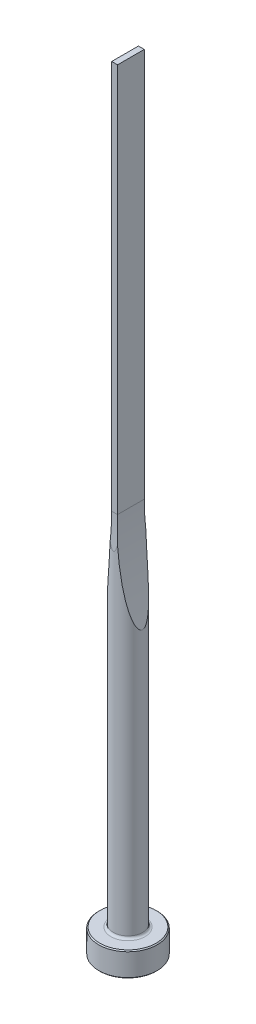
ISO-10303-21;
HEADER;
FILE_DESCRIPTION(('STEP AP214'),'2;1');
FILE_NAME('part.step','',(''),(''),'','','');
FILE_SCHEMA(('AUTOMOTIVE_DESIGN { 1 0 10303 214 1 1 1 1 }'));
ENDSEC;
DATA;
#1=APPLICATION_CONTEXT('core data for automotive mechanical design processes');
#2=APPLICATION_PROTOCOL_DEFINITION('international standard','automotive_design',2000,#1);
#3=PRODUCT_CONTEXT('',#1,'mechanical');
#4=PRODUCT('Part','Part','',(#3));
#5=PRODUCT_RELATED_PRODUCT_CATEGORY('part','',(#4));
#6=PRODUCT_DEFINITION_FORMATION('','',#4);
#7=PRODUCT_DEFINITION_CONTEXT('part definition',#1,'design');
#8=PRODUCT_DEFINITION('design','',#6,#7);
#9=PRODUCT_DEFINITION_SHAPE('','',#8);
#10=(LENGTH_UNIT() NAMED_UNIT(*) SI_UNIT(.MILLI.,.METRE.));
#11=(NAMED_UNIT(*) PLANE_ANGLE_UNIT() SI_UNIT($,.RADIAN.));
#12=(NAMED_UNIT(*) SI_UNIT($,.STERADIAN.) SOLID_ANGLE_UNIT());
#13=UNCERTAINTY_MEASURE_WITH_UNIT(LENGTH_MEASURE(1.E-05),#10,'distance_accuracy_value','');
#14=(GEOMETRIC_REPRESENTATION_CONTEXT(3) GLOBAL_UNCERTAINTY_ASSIGNED_CONTEXT((#13)) GLOBAL_UNIT_ASSIGNED_CONTEXT((#10,
#11,#12)) REPRESENTATION_CONTEXT('',''));
#15=CARTESIAN_POINT('',(0.,0.,0.));
#16=DIRECTION('',(0.,0.,1.));
#17=DIRECTION('',(1.,0.,0.));
#18=AXIS2_PLACEMENT_3D('',#15,#16,#17);
#19=CARTESIAN_POINT('',(0.,0.,0.));
#20=DIRECTION('',(0.,1.,0.));
#21=DIRECTION('',(-1.,0.,0.));
#22=AXIS2_PLACEMENT_3D('',#19,#20,#21);
#23=PLANE('',#22);
#24=CARTESIAN_POINT('',(0.,0.,0.));
#25=DIRECTION('',(0.,1.,0.));
#26=DIRECTION('',(-1.,0.,0.));
#27=AXIS2_PLACEMENT_3D('',#24,#25,#26);
#28=CIRCLE('',#27,5.8);
#29=CARTESIAN_POINT('',(-5.8,0.,0.));
#30=VERTEX_POINT('',#29);
#31=EDGE_CURVE('E133',#30,#30,#28,.T.);
#32=ORIENTED_EDGE('',*,*,#31,.F.);
#33=EDGE_LOOP('',(#32));
#34=FACE_BOUND('',#33,.T.);
#35=ADVANCED_FACE('F32',(#34),#23,.F.);
#36=CARTESIAN_POINT('',(0.,0.,0.));
#37=DIRECTION('',(0.,1.,0.));
#38=DIRECTION('',(-1.,0.,0.));
#39=AXIS2_PLACEMENT_3D('',#36,#37,#38);
#40=CONICAL_SURFACE('',#39,5.8,0.785398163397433);
#41=CARTESIAN_POINT('',(0.,0.200000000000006,0.));
#42=DIRECTION('',(0.,1.,0.));
#43=DIRECTION('',(-1.,0.,0.));
#44=AXIS2_PLACEMENT_3D('',#41,#42,#43);
#45=CIRCLE('',#44,6.);
#46=CARTESIAN_POINT('',(-6.,0.200000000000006,0.));
#47=VERTEX_POINT('',#46);
#48=EDGE_CURVE('E130',#47,#47,#45,.T.);
#49=ORIENTED_EDGE('',*,*,#48,.F.);
#50=EDGE_LOOP('',(#49));
#51=FACE_BOUND('',#50,.T.);
#52=ORIENTED_EDGE('',*,*,#31,.T.);
#53=EDGE_LOOP('',(#52));
#54=FACE_BOUND('',#53,.T.);
#55=ADVANCED_FACE('F171',(#51,#54),#40,.T.);
#56=CARTESIAN_POINT('',(0.,160.,0.));
#57=DIRECTION('',(0.,1.,0.));
#58=DIRECTION('',(-1.,0.,0.));
#59=AXIS2_PLACEMENT_3D('',#56,#57,#58);
#60=CYLINDRICAL_SURFACE('',#59,6.);
#61=CARTESIAN_POINT('',(0.,4.8,0.));
#62=DIRECTION('',(0.,1.,0.));
#63=DIRECTION('',(-1.,0.,0.));
#64=AXIS2_PLACEMENT_3D('',#61,#62,#63);
#65=CIRCLE('',#64,6.);
#66=CARTESIAN_POINT('',(-6.,4.8,0.));
#67=VERTEX_POINT('',#66);
#68=EDGE_CURVE('E127',#67,#67,#65,.T.);
#69=ORIENTED_EDGE('',*,*,#68,.F.);
#70=EDGE_LOOP('',(#69));
#71=FACE_BOUND('',#70,.T.);
#72=ORIENTED_EDGE('',*,*,#48,.T.);
#73=EDGE_LOOP('',(#72));
#74=FACE_BOUND('',#73,.T.);
#75=ADVANCED_FACE('F176',(#71,#74),#60,.T.);
#76=CARTESIAN_POINT('',(0.,4.8,0.));
#77=DIRECTION('',(0.,-1.,0.));
#78=DIRECTION('',(1.,0.,0.));
#79=AXIS2_PLACEMENT_3D('',#76,#77,#78);
#80=CONICAL_SURFACE('',#79,6.,0.785398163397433);
#81=CARTESIAN_POINT('',(0.,5.,0.));
#82=DIRECTION('',(0.,1.,0.));
#83=DIRECTION('',(-1.,0.,0.));
#84=AXIS2_PLACEMENT_3D('',#81,#82,#83);
#85=CIRCLE('',#84,5.8);
#86=CARTESIAN_POINT('',(-5.8,5.,0.));
#87=VERTEX_POINT('',#86);
#88=EDGE_CURVE('E124',#87,#87,#85,.T.);
#89=ORIENTED_EDGE('',*,*,#88,.F.);
#90=EDGE_LOOP('',(#89));
#91=FACE_BOUND('',#90,.T.);
#92=ORIENTED_EDGE('',*,*,#68,.T.);
#93=EDGE_LOOP('',(#92));
#94=FACE_BOUND('',#93,.T.);
#95=ADVANCED_FACE('F183',(#91,#94),#80,.T.);
#96=CARTESIAN_POINT('',(5.8,5.,0.));
#97=DIRECTION('',(0.,-1.,0.));
#98=DIRECTION('',(1.,0.,0.));
#99=AXIS2_PLACEMENT_3D('',#96,#97,#98);
#100=PLANE('',#99);
#101=CARTESIAN_POINT('',(0.,5.,0.));
#102=DIRECTION('',(0.,1.,0.));
#103=DIRECTION('',(-1.,0.,0.));
#104=AXIS2_PLACEMENT_3D('',#101,#102,#103);
#105=CIRCLE('',#104,3.50000000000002);
#106=CARTESIAN_POINT('',(-3.50000000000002,5.,0.));
#107=VERTEX_POINT('',#106);
#108=EDGE_CURVE('E121',#107,#107,#105,.T.);
#109=ORIENTED_EDGE('',*,*,#108,.F.);
#110=EDGE_LOOP('',(#109));
#111=FACE_BOUND('',#110,.T.);
#112=ORIENTED_EDGE('',*,*,#88,.T.);
#113=EDGE_LOOP('',(#112));
#114=FACE_BOUND('',#113,.T.);
#115=ADVANCED_FACE('F190',(#111,#114),#100,.F.);
#116=CARTESIAN_POINT('',(0.,5.5,0.));
#117=DIRECTION('',(0.,1.,0.));
#118=DIRECTION('',(-1.,0.,0.));
#119=AXIS2_PLACEMENT_3D('',#116,#117,#118);
#120=TOROIDAL_SURFACE('',#119,3.50000000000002,0.5);
#121=CARTESIAN_POINT('',(0.,5.50000000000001,0.));
#122=DIRECTION('',(0.,1.,0.));
#123=DIRECTION('',(-1.,0.,0.));
#124=AXIS2_PLACEMENT_3D('',#121,#122,#123);
#125=CIRCLE('',#124,3.00000000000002);
#126=CARTESIAN_POINT('',(-3.00000000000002,5.50000000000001,0.));
#127=VERTEX_POINT('',#126);
#128=EDGE_CURVE('E112',#127,#127,#125,.T.);
#129=ORIENTED_EDGE('',*,*,#128,.F.);
#130=EDGE_LOOP('',(#129));
#131=FACE_BOUND('',#130,.T.);
#132=ORIENTED_EDGE('',*,*,#108,.T.);
#133=EDGE_LOOP('',(#132));
#134=FACE_BOUND('',#133,.T.);
#135=ADVANCED_FACE('F168',(#131,#134),#120,.F.);
#136=CARTESIAN_POINT('',(0.,160.,0.));
#137=DIRECTION('',(0.,1.,0.));
#138=DIRECTION('',(-1.,0.,0.));
#139=AXIS2_PLACEMENT_3D('',#136,#137,#138);
#140=CYLINDRICAL_SURFACE('',#139,3.00000000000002);
#141=CARTESIAN_POINT('',(3.00000000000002,59.3544193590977,0.));
#142=CARTESIAN_POINT('',(2.99999954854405,59.3544212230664,0.0483527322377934));
#143=CARTESIAN_POINT('',(2.99881313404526,59.3594533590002,0.0967104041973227));
#144=CARTESIAN_POINT('',(2.99426254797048,59.3787765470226,0.191463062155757));
#145=CARTESIAN_POINT('',(2.99089325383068,59.393089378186,0.237853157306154));
#146=CARTESIAN_POINT('',(2.98152916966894,59.4329374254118,0.336831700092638));
#147=CARTESIAN_POINT('',(2.975130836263,59.4602014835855,0.388667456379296));
#148=CARTESIAN_POINT('',(2.96059089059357,59.5223295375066,0.48723644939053));
#149=CARTESIAN_POINT('',(2.95244592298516,59.5572081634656,0.533959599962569));
#150=CARTESIAN_POINT('',(2.9359154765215,59.6282186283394,0.618092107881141));
#151=CARTESIAN_POINT('',(2.92764370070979,59.6638402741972,0.655964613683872));
#152=CARTESIAN_POINT('',(2.91044814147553,59.7381158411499,0.728478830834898));
#153=CARTESIAN_POINT('',(2.901523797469,59.7767723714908,0.763117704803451));
#154=CARTESIAN_POINT('',(2.88320082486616,59.8563951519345,0.829666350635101));
#155=CARTESIAN_POINT('',(2.87380114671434,59.8973665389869,0.861569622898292));
#156=CARTESIAN_POINT('',(2.85468203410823,59.9809836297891,0.922941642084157));
#157=CARTESIAN_POINT('',(2.84496271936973,60.0236287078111,0.952411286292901));
#158=CARTESIAN_POINT('',(2.81968911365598,60.134908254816,1.02547116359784));
#159=CARTESIAN_POINT('',(2.80396615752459,60.2045035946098,1.06753742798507));
#160=CARTESIAN_POINT('',(2.77218749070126,60.3459768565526,1.14752701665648));
#161=CARTESIAN_POINT('',(2.75613160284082,60.417856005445,1.18544806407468));
#162=CARTESIAN_POINT('',(2.70764400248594,60.6362205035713,1.29422675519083));
#163=CARTESIAN_POINT('',(2.67494581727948,60.7851979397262,1.3599542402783));
#164=CARTESIAN_POINT('',(2.60936263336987,61.087784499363,1.4818909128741));
#165=CARTESIAN_POINT('',(2.57647755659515,61.2414138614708,1.53804822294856));
#166=CARTESIAN_POINT('',(2.52739820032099,61.4737193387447,1.61653965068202));
#167=CARTESIAN_POINT('',(2.51108896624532,61.5514201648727,1.64173338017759));
#168=CARTESIAN_POINT('',(2.4785721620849,61.7073703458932,1.69042535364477));
#169=CARTESIAN_POINT('',(2.46236458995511,61.7856196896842,1.71392363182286));
#170=CARTESIAN_POINT('',(2.41279480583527,62.0265657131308,1.78375004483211));
#171=CARTESIAN_POINT('',(2.37963510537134,62.1900242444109,1.82759992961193));
#172=CARTESIAN_POINT('',(2.3139773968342,62.5184020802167,1.91004661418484));
#173=CARTESIAN_POINT('',(2.28147949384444,62.6833216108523,1.94864258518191));
#174=CARTESIAN_POINT('',(2.21721762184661,63.0143525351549,2.02146122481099));
#175=CARTESIAN_POINT('',(2.18545403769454,63.1804644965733,2.05568164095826));
#176=CARTESIAN_POINT('',(2.12273524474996,63.5135705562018,2.12038170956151));
#177=CARTESIAN_POINT('',(2.09178008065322,63.6805647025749,2.15086115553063));
#178=CARTESIAN_POINT('',(2.00004880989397,64.1833980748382,2.2376186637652));
#179=CARTESIAN_POINT('',(1.94055790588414,64.5203110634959,2.28905054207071));
#180=CARTESIAN_POINT('',(1.82523631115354,65.1959867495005,2.3820086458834));
#181=CARTESIAN_POINT('',(1.76940460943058,65.5347489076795,2.42353761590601));
#182=CARTESIAN_POINT('',(1.66141797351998,66.2142411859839,2.49880495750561));
#183=CARTESIAN_POINT('',(1.60926869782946,66.5549735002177,2.5325315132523));
#184=CARTESIAN_POINT('',(1.50881206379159,67.2375840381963,2.59363395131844));
#185=CARTESIAN_POINT('',(1.46050493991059,67.5794623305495,2.62100944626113));
#186=CARTESIAN_POINT('',(1.36784640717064,68.2636554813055,2.67053368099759));
#187=CARTESIAN_POINT('',(1.32348974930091,68.6059691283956,2.6926894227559));
#188=CARTESIAN_POINT('',(1.23869133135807,69.2913239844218,2.73273481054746));
#189=CARTESIAN_POINT('',(1.19824954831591,69.6343651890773,2.75062448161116));
#190=CARTESIAN_POINT('',(1.11258358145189,70.3988597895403,2.78653554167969));
#191=CARTESIAN_POINT('',(1.0683524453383,70.8204661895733,2.80366809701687));
#192=CARTESIAN_POINT('',(0.985839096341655,71.6644171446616,2.83373353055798));
#193=CARTESIAN_POINT('',(0.947557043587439,72.0867617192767,2.84666629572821));
#194=CARTESIAN_POINT('',(0.876957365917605,72.932077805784,2.86920171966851));
#195=CARTESIAN_POINT('',(0.844640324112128,73.3550493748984,2.87880405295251));
#196=CARTESIAN_POINT('',(0.785986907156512,74.2014638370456,2.89536730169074));
#197=CARTESIAN_POINT('',(0.759650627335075,74.6249067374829,2.90232817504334));
#198=CARTESIAN_POINT('',(0.71294494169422,75.4725634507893,2.91415377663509));
#199=CARTESIAN_POINT('',(0.692581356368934,75.8967776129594,2.91901646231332));
#200=CARTESIAN_POINT('',(0.657860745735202,76.7454697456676,2.92703401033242));
#201=CARTESIAN_POINT('',(0.643503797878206,77.1699477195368,2.93018885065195));
#202=CARTESIAN_POINT('',(0.609450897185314,78.4435761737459,2.93754507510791));
#203=CARTESIAN_POINT('',(0.598768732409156,79.2929965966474,2.93963909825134));
#204=CARTESIAN_POINT('',(0.601453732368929,80.9900060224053,2.93909086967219));
#205=CARTESIAN_POINT('',(0.614770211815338,81.837595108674,2.93645859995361));
#206=CARTESIAN_POINT('',(0.652696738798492,83.1084208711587,2.92816045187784));
#207=CARTESIAN_POINT('',(0.668332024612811,83.5319561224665,2.92466918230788));
#208=CARTESIAN_POINT('',(0.705583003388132,84.378743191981,2.91590934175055));
#209=CARTESIAN_POINT('',(0.727198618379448,84.8019950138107,2.91064079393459));
#210=CARTESIAN_POINT('',(0.776386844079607,85.6478184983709,2.89790728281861));
#211=CARTESIAN_POINT('',(0.80395522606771,86.0703904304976,2.89044387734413));
#212=CARTESIAN_POINT('',(0.865048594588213,86.9150402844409,2.87275195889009));
#213=CARTESIAN_POINT('',(0.898573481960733,87.3371182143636,2.86252349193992));
#214=CARTESIAN_POINT('',(0.971563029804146,88.1806155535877,2.83858073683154));
#215=CARTESIAN_POINT('',(1.01102703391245,88.6020350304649,2.82486683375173));
#216=CARTESIAN_POINT('',(1.09587742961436,89.4441039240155,2.79304679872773));
#217=CARTESIAN_POINT('',(1.14126363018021,89.8647533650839,2.77494080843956));
#218=CARTESIAN_POINT('',(1.21662910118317,90.5199320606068,2.74238522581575));
#219=CARTESIAN_POINT('',(1.24458388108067,90.7547906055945,2.72984052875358));
#220=CARTESIAN_POINT('',(1.30232901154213,91.2241644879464,2.7027679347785));
#221=CARTESIAN_POINT('',(1.33211934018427,91.4586798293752,2.68824006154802));
#222=CARTESIAN_POINT('',(1.42423718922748,92.1616917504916,2.64127299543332));
#223=CARTESIAN_POINT('',(1.48930683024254,92.6296130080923,2.60545231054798));
#224=CARTESIAN_POINT('',(1.62662281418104,93.5632082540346,2.52202098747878));
#225=CARTESIAN_POINT('',(1.6988664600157,94.0288830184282,2.4744147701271));
#226=CARTESIAN_POINT('',(1.81245656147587,94.7250614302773,2.39106255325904));
#227=CARTESIAN_POINT('',(1.85118686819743,94.9567105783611,2.36129131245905));
#228=CARTESIAN_POINT('',(1.93034560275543,95.4190590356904,2.29703587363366));
#229=CARTESIAN_POINT('',(1.97077394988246,95.6497583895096,2.26255189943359));
#230=CARTESIAN_POINT('',(2.05334025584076,96.1103658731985,2.18789806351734));
#231=CARTESIAN_POINT('',(2.09548110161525,96.3402718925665,2.14771828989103));
#232=CARTESIAN_POINT('',(2.18131971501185,96.7985511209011,2.06048498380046));
#233=CARTESIAN_POINT('',(2.22501779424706,97.0269240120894,2.01343006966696));
#234=CARTESIAN_POINT('',(2.31379210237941,97.4813925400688,1.91075197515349));
#235=CARTESIAN_POINT('',(2.35886782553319,97.7074889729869,1.8551319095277));
#236=CARTESIAN_POINT('',(2.45014233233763,98.156402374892,1.73282311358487));
#237=CARTESIAN_POINT('',(2.49634052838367,98.3792209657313,1.66614007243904));
#238=CARTESIAN_POINT('',(2.5661732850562,98.7098404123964,1.55456125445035));
#239=CARTESIAN_POINT('',(2.58957692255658,98.8196133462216,1.51537263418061));
#240=CARTESIAN_POINT('',(2.63643492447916,99.0374268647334,1.43230444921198));
#241=CARTESIAN_POINT('',(2.6598893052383,99.1454667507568,1.38842304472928));
#242=CARTESIAN_POINT('',(2.7066912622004,99.3591902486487,1.29482368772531));
#243=CARTESIAN_POINT('',(2.73003870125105,99.4648712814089,1.2450996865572));
#244=CARTESIAN_POINT('',(2.77627728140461,99.672443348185,1.1382769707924));
#245=CARTESIAN_POINT('',(2.79916883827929,99.7743379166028,1.08118536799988));
#246=CARTESIAN_POINT('',(2.844214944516,99.9732972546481,0.956514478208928));
#247=CARTESIAN_POINT('',(2.86636091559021,100.070309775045,0.888844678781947));
#248=CARTESIAN_POINT('',(2.89788396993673,100.207450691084,0.77700352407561));
#249=CARTESIAN_POINT('',(2.9080858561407,100.251668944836,0.738109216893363));
#250=CARTESIAN_POINT('',(2.92766210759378,100.336249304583,0.656181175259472));
#251=CARTESIAN_POINT('',(2.9370376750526,100.376617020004,0.613153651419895));
#252=CARTESIAN_POINT('',(2.95286393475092,100.444571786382,0.531023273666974));
#253=CARTESIAN_POINT('',(2.95952977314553,100.473121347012,0.492767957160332));
#254=CARTESIAN_POINT('',(2.97174032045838,100.525321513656,0.412789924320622));
#255=CARTESIAN_POINT('',(2.97728453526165,100.548969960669,0.371065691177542));
#256=CARTESIAN_POINT('',(2.98688558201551,100.589867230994,0.283667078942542));
#257=CARTESIAN_POINT('',(2.99092210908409,100.607028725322,0.237948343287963));
#258=CARTESIAN_POINT('',(2.99690909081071,100.632465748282,0.143990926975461));
#259=CARTESIAN_POINT('',(2.99886455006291,100.640762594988,0.0957585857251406));
#260=CARTESIAN_POINT('',(3.00031309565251,100.64690925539,0.00370587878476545));
#261=CARTESIAN_POINT('',(3.00004412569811,100.645768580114,-0.0400433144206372));
#262=CARTESIAN_POINT('',(2.99764218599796,100.635574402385,-0.126566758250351));
#263=CARTESIAN_POINT('',(2.99550742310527,100.626513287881,-0.169340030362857));
#264=CARTESIAN_POINT('',(2.98914571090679,100.599476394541,-0.259584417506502));
#265=CARTESIAN_POINT('',(2.98463061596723,100.580271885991,-0.306658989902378));
#266=CARTESIAN_POINT('',(2.9739614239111,100.534797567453,-0.39703194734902));
#267=CARTESIAN_POINT('',(2.96780425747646,100.508514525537,-0.440323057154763));
#268=CARTESIAN_POINT('',(2.94983205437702,100.431604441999,-0.550830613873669));
#269=CARTESIAN_POINT('',(2.93698705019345,100.376452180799,-0.61468507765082));
#270=CARTESIAN_POINT('',(2.90952748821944,100.257956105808,-0.733746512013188));
#271=CARTESIAN_POINT('',(2.89490771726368,100.194588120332,-0.788926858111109));
#272=CARTESIAN_POINT('',(2.85840241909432,100.035497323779,-0.913992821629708));
#273=CARTESIAN_POINT('',(2.83601822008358,99.9372555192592,-0.980485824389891));
#274=CARTESIAN_POINT('',(2.79031862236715,99.7350119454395,-1.10382067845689));
#275=CARTESIAN_POINT('',(2.76700129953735,99.6309980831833,-1.16064116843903));
#276=CARTESIAN_POINT('',(2.71985245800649,99.4188449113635,-1.26720476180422));
#277=CARTESIAN_POINT('',(2.69601887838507,99.3106867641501,-1.31690902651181));
#278=CARTESIAN_POINT('',(2.64827520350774,99.092056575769,-1.41045614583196));
#279=CARTESIAN_POINT('',(2.62436521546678,98.9815870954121,-1.45430512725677));
#280=CARTESIAN_POINT('',(2.57821293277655,98.7663606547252,-1.53453935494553));
#281=CARTESIAN_POINT('',(2.5559662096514,98.6617167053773,-1.57122780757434));
#282=CARTESIAN_POINT('',(2.51161973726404,98.4512556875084,-1.6411813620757));
#283=CARTESIAN_POINT('',(2.48952000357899,98.3454384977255,-1.67444610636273));
#284=CARTESIAN_POINT('',(2.42351886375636,98.0265162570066,-1.76990864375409));
#285=CARTESIAN_POINT('',(2.37993617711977,97.8120367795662,-1.8277400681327));
#286=CARTESIAN_POINT('',(2.29385170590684,97.3802412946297,-1.93466697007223));
#287=CARTESIAN_POINT('',(2.25135244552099,97.1629201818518,-1.98374340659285));
#288=CARTESIAN_POINT('',(2.16769555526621,96.726532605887,-2.07482958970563));
#289=CARTESIAN_POINT('',(2.12653806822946,96.5074659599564,-2.11683858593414));
#290=CARTESIAN_POINT('',(2.04560034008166,96.0676199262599,-2.19515180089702));
#291=CARTESIAN_POINT('',(2.00582293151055,95.8468380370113,-2.23144477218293));
#292=CARTESIAN_POINT('',(1.92779808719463,95.4042560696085,-2.29918715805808));
#293=CARTESIAN_POINT('',(1.88955073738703,95.1824559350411,-2.33063630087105));
#294=CARTESIAN_POINT('',(1.81468937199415,94.7383599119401,-2.38938543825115));
#295=CARTESIAN_POINT('',(1.77807314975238,94.5160651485,-2.41669116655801));
#296=CARTESIAN_POINT('',(1.70645210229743,94.0708205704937,-2.46778257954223));
#297=CARTESIAN_POINT('',(1.67144724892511,93.8478707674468,-2.49156832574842));
#298=CARTESIAN_POINT('',(1.5691113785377,93.1796617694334,-2.55822914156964));
#299=CARTESIAN_POINT('',(1.5042117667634,92.7335764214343,-2.5965948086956));
#300=CARTESIAN_POINT('',(1.3810383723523,91.8397827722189,-2.66414008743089));
#301=CARTESIAN_POINT('',(1.32276521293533,91.3920743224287,-2.69331883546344));
#302=CARTESIAN_POINT('',(1.21290377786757,90.495292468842,-2.74454680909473));
#303=CARTESIAN_POINT('',(1.16131763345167,90.0462186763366,-2.76659376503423));
#304=CARTESIAN_POINT('',(1.06489586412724,89.1471068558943,-2.80511813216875));
#305=CARTESIAN_POINT('',(1.02006035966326,88.6970688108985,-2.82159544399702));
#306=CARTESIAN_POINT('',(0.937096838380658,87.7954538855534,-2.85022399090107));
#307=CARTESIAN_POINT('',(0.89898057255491,87.3438756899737,-2.86236768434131));
#308=CARTESIAN_POINT('',(0.829568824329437,86.4401156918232,-2.88324951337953));
#309=CARTESIAN_POINT('',(0.798273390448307,85.9879338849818,-2.89198762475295));
#310=CARTESIAN_POINT('',(0.742520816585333,85.0831895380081,-2.9068013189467));
#311=CARTESIAN_POINT('',(0.718062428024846,84.6306270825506,-2.91287738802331));
#312=CARTESIAN_POINT('',(0.675984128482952,83.7251557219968,-2.92292882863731));
#313=CARTESIAN_POINT('',(0.658364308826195,83.2722468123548,-2.92690417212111));
#314=CARTESIAN_POINT('',(0.629994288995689,82.3670163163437,-2.93314123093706));
#315=CARTESIAN_POINT('',(0.619231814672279,81.9146951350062,-2.93540600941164));
#316=CARTESIAN_POINT('',(0.60452928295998,81.0099297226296,-2.93846909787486));
#317=CARTESIAN_POINT('',(0.600589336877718,80.5574854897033,-2.93926738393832));
#318=CARTESIAN_POINT('',(0.599533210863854,79.6525553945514,-2.93948298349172));
#319=CARTESIAN_POINT('',(0.602417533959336,79.2000695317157,-2.93890019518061));
#320=CARTESIAN_POINT('',(0.615010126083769,78.2952041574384,-2.93629085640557));
#321=CARTESIAN_POINT('',(0.624718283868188,77.8428246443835,-2.93426432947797));
#322=CARTESIAN_POINT('',(0.650943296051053,76.9387039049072,-2.92855815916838));
#323=CARTESIAN_POINT('',(0.667453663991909,76.4869624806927,-2.92488009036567));
#324=CARTESIAN_POINT('',(0.707277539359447,75.5838066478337,-2.91550637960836));
#325=CARTESIAN_POINT('',(0.730590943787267,75.1323922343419,-2.90981076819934));
#326=CARTESIAN_POINT('',(0.784010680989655,74.2300511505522,-2.89587454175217));
#327=CARTESIAN_POINT('',(0.814116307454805,73.7791244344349,-2.88763419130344));
#328=CARTESIAN_POINT('',(0.881110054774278,72.8778533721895,-2.86790293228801));
#329=CARTESIAN_POINT('',(0.917998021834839,72.4275090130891,-2.85641209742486));
#330=CARTESIAN_POINT('',(0.989843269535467,71.6247218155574,-2.83219298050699));
#331=CARTESIAN_POINT('',(1.02349736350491,71.2721377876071,-2.82026773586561));
#332=CARTESIAN_POINT('',(1.09495320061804,70.5675028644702,-2.79330218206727));
#333=CARTESIAN_POINT('',(1.13275499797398,70.2154519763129,-2.77826183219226));
#334=CARTESIAN_POINT('',(1.21247129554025,69.5121549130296,-2.74441085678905));
#335=CARTESIAN_POINT('',(1.25438393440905,69.1609084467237,-2.72560193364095));
#336=CARTESIAN_POINT('',(1.3423095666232,68.4592142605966,-2.68338899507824));
#337=CARTESIAN_POINT('',(1.38832247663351,68.1087665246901,-2.65998507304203));
#338=CARTESIAN_POINT('',(1.5017496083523,67.2825803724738,-2.59814180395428));
#339=CARTESIAN_POINT('',(1.57089655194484,66.8072470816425,-2.55732417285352));
#340=CARTESIAN_POINT('',(1.6801477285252,66.0961366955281,-2.48575504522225));
#341=CARTESIAN_POINT('',(1.71748757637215,65.8594089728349,-2.46017412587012));
#342=CARTESIAN_POINT('',(1.79397886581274,65.3867209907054,-2.40496753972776));
#343=CARTESIAN_POINT('',(1.83313026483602,65.150760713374,-2.37534196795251));
#344=CARTESIAN_POINT('',(1.92804621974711,64.5924756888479,-2.29947574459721));
#345=CARTESIAN_POINT('',(1.9845889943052,64.2705620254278,-2.25114704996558));
#346=CARTESIAN_POINT('',(2.10083962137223,63.629148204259,-2.14308474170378));
#347=CARTESIAN_POINT('',(2.16054773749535,63.3096482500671,-2.08335017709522));
#348=CARTESIAN_POINT('',(2.263969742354,62.7722346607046,-1.96935933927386));
#349=CARTESIAN_POINT('',(2.30694621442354,62.5533391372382,-1.91908164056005));
#350=CARTESIAN_POINT('',(2.39404167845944,62.1182201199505,-1.80928432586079));
#351=CARTESIAN_POINT('',(2.43815985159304,61.9019948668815,-1.74977118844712));
#352=CARTESIAN_POINT('',(2.51383172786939,61.5378652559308,-1.63820252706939));
#353=CARTESIAN_POINT('',(2.54517613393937,61.3889602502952,-1.58928214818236));
#354=CARTESIAN_POINT('',(2.6081213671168,61.0935966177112,-1.48374973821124));
#355=CARTESIAN_POINT('',(2.63972253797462,60.9471425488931,-1.42712485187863));
#356=CARTESIAN_POINT('',(2.68802167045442,60.7259168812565,-1.33262383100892));
#357=CARTESIAN_POINT('',(2.70478476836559,60.649622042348,-1.29834782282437));
#358=CARTESIAN_POINT('',(2.73816263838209,60.4986281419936,-1.22639444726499));
#359=CARTESIAN_POINT('',(2.754777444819,60.4239287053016,-1.18871789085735));
#360=CARTESIAN_POINT('',(2.78767783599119,60.2768730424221,-1.10936597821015));
#361=CARTESIAN_POINT('',(2.80396421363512,60.2045108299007,-1.0677021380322));
#362=CARTESIAN_POINT('',(2.83603012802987,60.0628273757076,-0.979360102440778));
#363=CARTESIAN_POINT('',(2.8518100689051,59.9935036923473,-0.932686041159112));
#364=CARTESIAN_POINT('',(2.87943742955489,59.8727563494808,-0.842958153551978));
#365=CARTESIAN_POINT('',(2.8914399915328,59.8205263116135,-0.801048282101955));
#366=CARTESIAN_POINT('',(2.91460908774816,59.7200868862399,-0.71215828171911));
#367=CARTESIAN_POINT('',(2.92577385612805,59.6718859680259,-0.665167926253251));
#368=CARTESIAN_POINT('',(2.9468780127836,59.5810773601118,-0.564450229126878));
#369=CARTESIAN_POINT('',(2.95679810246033,59.5385572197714,-0.510637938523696));
#370=CARTESIAN_POINT('',(2.97430949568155,59.4636945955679,-0.395983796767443));
#371=CARTESIAN_POINT('',(2.98191077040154,59.4313085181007,-0.335173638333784));
#372=CARTESIAN_POINT('',(2.99163165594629,59.3899515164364,-0.228060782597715));
#373=CARTESIAN_POINT('',(2.99473052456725,59.3767888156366,-0.183494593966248));
#374=CARTESIAN_POINT('',(2.99891293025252,59.3590302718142,-0.0926180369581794));
#375=CARTESIAN_POINT('',(3.00000043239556,59.3544175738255,-0.0463112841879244));
#376=CARTESIAN_POINT('',(3.00000000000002,59.3544193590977,0.));
#377=B_SPLINE_CURVE_WITH_KNOTS('',3,(#141,#142,#143,#144,#145,#146,#147,#148,#149,#150,#151,
#152,#153,#154,#155,#156,#157,#158,#159,#160,#161,#162,#163,#164,#165,#166,#167,#168,#169,#170,
#171,#172,#173,#174,#175,#176,#177,#178,#179,#180,#181,#182,#183,#184,#185,#186,#187,#188,#189,
#190,#191,#192,#193,#194,#195,#196,#197,#198,#199,#200,#201,#202,#203,#204,#205,#206,#207,#208,
#209,#210,#211,#212,#213,#214,#215,#216,#217,#218,#219,#220,#221,#222,#223,#224,#225,#226,#227,
#228,#229,#230,#231,#232,#233,#234,#235,#236,#237,#238,#239,#240,#241,#242,#243,#244,#245,#246,
#247,#248,#249,#250,#251,#252,#253,#254,#255,#256,#257,#258,#259,#260,#261,#262,#263,#264,#265,
#266,#267,#268,#269,#270,#271,#272,#273,#274,#275,#276,#277,#278,#279,#280,#281,#282,#283,#284,
#285,#286,#287,#288,#289,#290,#291,#292,#293,#294,#295,#296,#297,#298,#299,#300,#301,#302,#303,
#304,#305,#306,#307,#308,#309,#310,#311,#312,#313,#314,#315,#316,#317,#318,#319,#320,#321,#322,
#323,#324,#325,#326,#327,#328,#329,#330,#331,#332,#333,#334,#335,#336,#337,#338,#339,#340,#341,
#342,#343,#344,#345,#346,#347,#348,#349,#350,#351,#352,#353,#354,#355,#356,#357,#358,#359,#360,
#361,#362,#363,#364,#365,#366,#367,#368,#369,#370,#371,#372,#373,#374,#375,#376),.UNSPECIFIED.,
.T.,.F.,(4,2,2,2,2,2,2,2,2,2,2,2,2,2,2,2,2,2,2,2,2,2,2,2,2,2,2,2,2,2,2,2,2,2,2,2,2,2,2,2,2,2,2,
2,2,2,2,2,2,2,2,2,2,2,2,2,2,2,2,2,2,2,2,2,2,2,2,2,2,2,2,2,2,2,2,2,2,2,2,2,2,2,2,2,2,2,2,2,2,2,2,
2,2,2,2,2,2,2,2,2,2,2,2,2,2,2,2,2,2,2,2,2,2,2,2,2,2,4),(0.,0.144818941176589,0.289978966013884,
0.465715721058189,0.641793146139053,0.79950453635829,0.957353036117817,1.11556674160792,
1.27372185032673,1.52200926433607,1.77043237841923,2.26811973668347,2.76842457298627,
3.01829386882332,3.2681581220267,3.7854045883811,4.30273255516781,4.82032577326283,
5.33794754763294,6.3756155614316,7.41299565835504,8.4519366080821,9.49094091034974,
10.5285434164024,11.566139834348,12.8388673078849,14.1116290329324,15.3845151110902,
16.6574214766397,17.9315642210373,19.2057233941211,21.7538152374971,24.2965317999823,
25.5680080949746,26.8394678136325,28.1100272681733,29.3805655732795,30.6509635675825,
31.9213205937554,32.6318531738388,33.3423772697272,34.7635500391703,36.1841905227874,
36.8943791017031,37.6045339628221,38.3159401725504,39.0274895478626,39.7387807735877,
40.449707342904,40.8062812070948,41.1629953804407,41.5200821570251,41.8768267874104,
42.2368103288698,42.4159185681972,42.594761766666,42.7390562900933,42.8834142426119,
43.0296516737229,43.1755366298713,43.3060358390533,43.4366606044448,43.58893776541,
43.7415015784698,43.9960974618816,44.251460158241,44.612731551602,44.9747907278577,
45.3387562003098,45.7023377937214,46.0415653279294,46.3808282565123,47.0596667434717,
47.7399640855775,48.4203336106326,49.1020256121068,49.7837558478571,50.4645339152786,
51.1453000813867,52.502337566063,53.8595025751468,55.217099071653,56.5747197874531,
57.9346917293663,59.2946733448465,60.654406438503,62.0141576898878,63.3714681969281,
64.7288008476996,66.0862335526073,67.4436441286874,68.7997632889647,70.1558619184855,
71.5118195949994,72.8677465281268,73.930873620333,74.9940146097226,76.056676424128,
77.1193166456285,78.5652732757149,79.2882874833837,80.0112847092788,81.0023058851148,
81.9934097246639,82.6792779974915,83.3646672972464,83.8440461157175,84.3242348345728,
84.580083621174,84.8358715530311,85.090941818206,85.3458032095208,85.5496747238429,
85.7539645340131,85.961108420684,86.1673485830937,86.3063275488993,86.4450322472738),.UNSPECIFIED.);
#378=CARTESIAN_POINT('',(0.75376324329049,74.7413175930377,-2.90376324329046));
#379=VERTEX_POINT('',#378);
#380=CARTESIAN_POINT('',(0.75376324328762,74.7413175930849,2.90376324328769));
#381=VERTEX_POINT('',#380);
#382=EDGE_CURVE('E138',#379,#381,#377,.T.);
#383=ORIENTED_EDGE('',*,*,#382,.T.);
#384=CARTESIAN_POINT('',(-1.19895788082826,80.,2.74999999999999));
#385=CARTESIAN_POINT('',(-1.19897952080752,80.5078240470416,2.7500005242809));
#386=CARTESIAN_POINT('',(-1.18927252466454,81.0156821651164,2.7543014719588));
#387=CARTESIAN_POINT('',(-1.15875125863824,81.7777588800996,2.76719867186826));
#388=CARTESIAN_POINT('',(-1.14587302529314,82.0323726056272,2.77259034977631));
#389=CARTESIAN_POINT('',(-1.11408427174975,82.5410752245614,2.78552021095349));
#390=CARTESIAN_POINT('',(-1.09517627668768,82.7951642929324,2.79305749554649));
#391=CARTESIAN_POINT('',(-1.05054489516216,83.2992875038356,2.81014523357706));
#392=CARTESIAN_POINT('',(-1.02491501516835,83.5493308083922,2.81966772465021));
#393=CARTESIAN_POINT('',(-0.964932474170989,84.0487156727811,2.84076574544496));
#394=CARTESIAN_POINT('',(-0.930566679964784,84.2980555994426,2.85234435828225));
#395=CARTESIAN_POINT('',(-0.870049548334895,84.6696537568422,2.87113933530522));
#396=CARTESIAN_POINT('',(-0.848472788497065,84.792694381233,2.87761721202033));
#397=CARTESIAN_POINT('',(-0.801568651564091,85.0380271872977,2.89103629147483));
#398=CARTESIAN_POINT('',(-0.776241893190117,85.1603194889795,2.89797741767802));
#399=CARTESIAN_POINT('',(-0.720753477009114,85.4034742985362,2.91227256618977));
#400=CARTESIAN_POINT('',(-0.690603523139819,85.5243395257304,2.91962556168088));
#401=CARTESIAN_POINT('',(-0.623527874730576,85.7641294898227,2.93469409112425));
#402=CARTESIAN_POINT('',(-0.586609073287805,85.8830560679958,2.94240925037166));
#403=CARTESIAN_POINT('',(-0.532225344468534,86.0331253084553,2.95243594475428));
#404=CARTESIAN_POINT('',(-0.519782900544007,86.0660915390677,2.9546570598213));
#405=CARTESIAN_POINT('',(-0.493824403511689,86.1316010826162,2.95910656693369));
#406=CARTESIAN_POINT('',(-0.480308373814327,86.1641444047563,2.96133495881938));
#407=CARTESIAN_POINT('',(-0.437923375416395,86.2607815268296,2.96800415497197));
#408=CARTESIAN_POINT('',(-0.407160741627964,86.3240456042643,2.97243989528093));
#409=CARTESIAN_POINT('',(-0.339480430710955,86.4432950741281,2.98092262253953));
#410=CARTESIAN_POINT('',(-0.302974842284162,86.4994884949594,2.98497775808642));
#411=CARTESIAN_POINT('',(-0.243249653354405,86.5706099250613,2.99016761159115));
#412=CARTESIAN_POINT('',(-0.2253806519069,86.5899122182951,2.99158318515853));
#413=CARTESIAN_POINT('',(-0.18706307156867,86.6257850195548,2.99422420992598));
#414=CARTESIAN_POINT('',(-0.166623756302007,86.642364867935,2.9954503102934));
#415=CARTESIAN_POINT('',(-0.132225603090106,86.6647469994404,2.9971102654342));
#416=CARTESIAN_POINT('',(-0.11929686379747,86.6721061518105,2.99765718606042));
#417=CARTESIAN_POINT('',(-0.0924786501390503,86.6848335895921,2.99860424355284));
#418=CARTESIAN_POINT('',(-0.0785901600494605,86.6902038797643,2.99900452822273));
#419=CARTESIAN_POINT('',(-0.0498799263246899,86.6984547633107,2.99961993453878));
#420=CARTESIAN_POINT('',(-0.0350488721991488,86.7013042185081,2.99983274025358));
#421=CARTESIAN_POINT('',(-0.00511706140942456,86.7039833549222,3.00003281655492));
#422=CARTESIAN_POINT('',(0.00998340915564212,86.7038160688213,3.00002031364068));
#423=CARTESIAN_POINT('',(0.0377473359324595,86.7007339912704,2.99979016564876));
#424=CARTESIAN_POINT('',(0.0504568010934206,86.6982058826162,2.99960139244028));
#425=CARTESIAN_POINT('',(0.0753269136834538,86.6912160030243,2.9990800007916));
#426=CARTESIAN_POINT('',(0.0874870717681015,86.6867525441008,2.99874725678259));
#427=CARTESIAN_POINT('',(0.117304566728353,86.6734908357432,2.99776000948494));
#428=CARTESIAN_POINT('',(0.134490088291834,86.6636473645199,2.99702831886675));
#429=CARTESIAN_POINT('',(0.167153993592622,86.6414692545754,2.99538445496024));
#430=CARTESIAN_POINT('',(0.182627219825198,86.6291273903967,2.99447175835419));
#431=CARTESIAN_POINT('',(0.225718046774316,86.5906116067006,2.99163284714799));
#432=CARTESIAN_POINT('',(0.251307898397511,86.56221507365,2.98955095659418));
#433=CARTESIAN_POINT('',(0.29858395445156,86.5023955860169,2.98519748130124));
#434=CARTESIAN_POINT('',(0.320256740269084,86.4709627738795,2.98292528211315));
#435=CARTESIAN_POINT('',(0.376076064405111,86.3821026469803,2.9765520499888));
#436=CARTESIAN_POINT('',(0.40735125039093,86.3228981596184,2.97236032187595));
#437=CARTESIAN_POINT('',(0.464715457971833,86.2019914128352,2.96392635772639));
#438=CARTESIAN_POINT('',(0.490790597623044,86.1402829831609,2.95968401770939));
#439=CARTESIAN_POINT('',(0.539393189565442,86.0151533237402,2.95121450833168));
#440=CARTESIAN_POINT('',(0.561903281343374,85.951725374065,2.94698750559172));
#441=CARTESIAN_POINT('',(0.604138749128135,85.824059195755,2.93861747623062));
#442=CARTESIAN_POINT('',(0.62386791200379,85.7598222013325,2.93447434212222));
#443=CARTESIAN_POINT('',(0.687009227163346,85.5416029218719,2.92063784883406));
#444=CARTESIAN_POINT('',(0.725502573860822,85.3861879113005,2.91118093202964));
#445=CARTESIAN_POINT('',(0.794909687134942,85.0736090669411,2.89298537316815));
#446=CARTESIAN_POINT('',(0.825818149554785,84.9164440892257,2.88424723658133));
#447=CARTESIAN_POINT('',(0.882130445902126,84.6006711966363,2.86752741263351));
#448=CARTESIAN_POINT('',(0.907519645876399,84.4420605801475,2.85954776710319));
#449=CARTESIAN_POINT('',(0.953912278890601,84.1242228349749,2.84440447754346));
#450=CARTESIAN_POINT('',(0.974917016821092,83.9649959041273,2.83724059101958));
#451=CARTESIAN_POINT('',(1.03276252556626,83.4851511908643,2.81693320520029));
#452=CARTESIAN_POINT('',(1.06419241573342,83.1638255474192,2.8050512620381));
#453=CARTESIAN_POINT('',(1.11623470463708,82.5208794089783,2.78473743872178));
#454=CARTESIAN_POINT('',(1.13686835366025,82.199260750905,2.77629878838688));
#455=CARTESIAN_POINT('',(1.16917424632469,81.5546671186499,2.76284984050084));
#456=CARTESIAN_POINT('',(1.1808230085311,81.2316907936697,2.75784852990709));
#457=CARTESIAN_POINT('',(1.1959420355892,80.5855107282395,2.75132454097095));
#458=CARTESIAN_POINT('',(1.19941212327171,80.2623069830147,2.74980193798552));
#459=CARTESIAN_POINT('',(1.19840705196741,79.6145622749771,2.75024017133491));
#460=CARTESIAN_POINT('',(1.19389860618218,79.2900213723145,2.75221560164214));
#461=CARTESIAN_POINT('',(1.17656472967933,78.6413194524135,2.75967187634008));
#462=CARTESIAN_POINT('',(1.16374248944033,78.3171583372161,2.76515137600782));
#463=CARTESIAN_POINT('',(1.1290319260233,77.6736789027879,2.77950240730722));
#464=CARTESIAN_POINT('',(1.10726533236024,77.3543530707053,2.78832827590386));
#465=CARTESIAN_POINT('',(1.05280621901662,76.7162712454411,2.80935794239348));
#466=CARTESIAN_POINT('',(1.02009944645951,76.3975165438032,2.82156614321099));
#467=CARTESIAN_POINT('',(0.960080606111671,75.9219501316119,2.84230016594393));
#468=CARTESIAN_POINT('',(0.938338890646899,75.7643795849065,2.84958669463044));
#469=CARTESIAN_POINT('',(0.890325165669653,75.4498925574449,2.86495508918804));
#470=CARTESIAN_POINT('',(0.864051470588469,75.2929763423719,2.87303725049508));
#471=CARTESIAN_POINT('',(0.805707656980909,74.9806378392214,2.88993979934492));
#472=CARTESIAN_POINT('',(0.773651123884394,74.8252129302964,2.89875843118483));
#473=CARTESIAN_POINT('',(0.701473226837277,74.5163138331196,2.91708269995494));
#474=CARTESIAN_POINT('',(0.661358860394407,74.3628380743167,2.92658773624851));
#475=CARTESIAN_POINT('',(0.59957114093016,74.1622791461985,2.93951368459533));
#476=CARTESIAN_POINT('',(0.583753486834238,74.1133825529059,2.94270568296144));
#477=CARTESIAN_POINT('',(0.550376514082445,74.0161514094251,2.9491318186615));
#478=CARTESIAN_POINT('',(0.532816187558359,73.9678172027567,2.9523659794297));
#479=CARTESIAN_POINT('',(0.495474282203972,73.8718768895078,2.95886221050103));
#480=CARTESIAN_POINT('',(0.475687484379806,73.8242728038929,2.96212432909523));
#481=CARTESIAN_POINT('',(0.433230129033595,73.7303798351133,2.96863184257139));
#482=CARTESIAN_POINT('',(0.410562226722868,73.6840897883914,2.97187725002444));
#483=CARTESIAN_POINT('',(0.360948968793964,73.5932525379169,2.97831355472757));
#484=CARTESIAN_POINT('',(0.333963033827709,73.54872744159,2.9815035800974));
#485=CARTESIAN_POINT('',(0.273823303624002,73.4640019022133,2.9876333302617));
#486=CARTESIAN_POINT('',(0.240714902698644,73.423772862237,2.99057467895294));
#487=CARTESIAN_POINT('',(0.187908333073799,73.375308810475,2.99414413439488));
#488=CARTESIAN_POINT('',(0.172443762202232,73.3625865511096,2.99508437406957));
#489=CARTESIAN_POINT('',(0.13976912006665,73.3396025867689,2.9967870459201));
#490=CARTESIAN_POINT('',(0.122564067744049,73.3293340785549,2.99754996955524));
#491=CARTESIAN_POINT('',(0.0920979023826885,73.3150686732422,2.99861155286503));
#492=CARTESIAN_POINT('',(0.0792928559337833,73.3101148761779,2.99898077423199));
#493=CARTESIAN_POINT('',(0.0530412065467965,73.3023526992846,2.99955968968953));
#494=CARTESIAN_POINT('',(0.0395953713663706,73.2995418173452,2.99976956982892));
#495=CARTESIAN_POINT('',(0.0123234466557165,73.2963783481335,3.00000579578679));
#496=CARTESIAN_POINT('',(-0.00150445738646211,73.2960408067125,3.00003101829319));
#497=CARTESIAN_POINT('',(-0.0289863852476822,73.2979088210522,2.99989150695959));
#498=CARTESIAN_POINT('',(-0.0426403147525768,73.3001157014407,2.99972667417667));
#499=CARTESIAN_POINT('',(-0.0713132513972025,73.3072893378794,2.99919143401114));
#500=CARTESIAN_POINT('',(-0.0862409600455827,73.312611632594,2.9987945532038));
#501=CARTESIAN_POINT('',(-0.115034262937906,73.3255893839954,2.99782852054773));
#502=CARTESIAN_POINT('',(-0.128897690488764,73.3332494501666,2.9972590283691));
#503=CARTESIAN_POINT('',(-0.163968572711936,73.3556775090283,2.99559526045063));
#504=CARTESIAN_POINT('',(-0.184247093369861,73.3718697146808,2.99439742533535));
#505=CARTESIAN_POINT('',(-0.2222859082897,73.4069419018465,2.99181430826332));
#506=CARTESIAN_POINT('',(-0.240038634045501,73.4258296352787,2.99042848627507));
#507=CARTESIAN_POINT('',(-0.280818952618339,73.4738008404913,2.98692562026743));
#508=CARTESIAN_POINT('',(-0.302801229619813,73.5037572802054,2.98475182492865));
#509=CARTESIAN_POINT('',(-0.343876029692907,73.5656071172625,2.98029708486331));
#510=CARTESIAN_POINT('',(-0.362961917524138,73.5975047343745,2.97801590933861));
#511=CARTESIAN_POINT('',(-0.417189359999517,73.6952833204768,2.97107815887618));
#512=CARTESIAN_POINT('',(-0.449076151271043,73.7629467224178,2.96634960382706));
#513=CARTESIAN_POINT('',(-0.507522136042,73.9004515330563,2.95690285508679));
#514=CARTESIAN_POINT('',(-0.534078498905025,73.9702940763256,2.95218466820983));
#515=CARTESIAN_POINT('',(-0.583437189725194,74.1113147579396,2.94282667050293));
#516=CARTESIAN_POINT('',(-0.606238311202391,74.1824933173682,2.93818688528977));
#517=CARTESIAN_POINT('',(-0.670588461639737,74.3976071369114,2.92442540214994));
#518=CARTESIAN_POINT('',(-0.707956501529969,74.5427891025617,2.91548441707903));
#519=CARTESIAN_POINT('',(-0.775545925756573,74.8347309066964,2.89822529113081));
#520=CARTESIAN_POINT('',(-0.805769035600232,74.9814903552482,2.88990700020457));
#521=CARTESIAN_POINT('',(-0.8609375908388,75.2758101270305,2.87395360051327));
#522=CARTESIAN_POINT('',(-0.885890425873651,75.423369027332,2.86631754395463));
#523=CARTESIAN_POINT('',(-0.937056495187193,75.7534864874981,2.8500533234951));
#524=CARTESIAN_POINT('',(-0.962216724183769,75.936215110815,2.84160657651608));
#525=CARTESIAN_POINT('',(-1.00766798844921,76.3023321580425,2.82580502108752));
#526=CARTESIAN_POINT('',(-1.02795847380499,76.4857206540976,2.8184503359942));
#527=CARTESIAN_POINT('',(-1.08284239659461,77.0369289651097,2.79803797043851));
#528=CARTESIAN_POINT('',(-1.11139411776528,77.405415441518,2.78665055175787));
#529=CARTESIAN_POINT('',(-1.15618392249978,78.1449701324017,2.768355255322));
#530=CARTESIAN_POINT('',(-1.17236247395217,78.5160422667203,2.76146905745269));
#531=CARTESIAN_POINT('',(-1.19373453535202,79.2580705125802,2.75229417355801));
#532=CARTESIAN_POINT('',(-1.19894207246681,79.629026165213,2.74999961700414));
#533=CARTESIAN_POINT('',(-1.19895788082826,80.,2.74999999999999));
#534=B_SPLINE_CURVE_WITH_KNOTS('',3,(#384,#385,#386,#387,#388,#389,#390,#391,#392,#393,#394,
#395,#396,#397,#398,#399,#400,#401,#402,#403,#404,#405,#406,#407,#408,#409,#410,#411,#412,#413,
#414,#415,#416,#417,#418,#419,#420,#421,#422,#423,#424,#425,#426,#427,#428,#429,#430,#431,#432,
#433,#434,#435,#436,#437,#438,#439,#440,#441,#442,#443,#444,#445,#446,#447,#448,#449,#450,#451,
#452,#453,#454,#455,#456,#457,#458,#459,#460,#461,#462,#463,#464,#465,#466,#467,#468,#469,#470,
#471,#472,#473,#474,#475,#476,#477,#478,#479,#480,#481,#482,#483,#484,#485,#486,#487,#488,#489,
#490,#491,#492,#493,#494,#495,#496,#497,#498,#499,#500,#501,#502,#503,#504,#505,#506,#507,#508,
#509,#510,#511,#512,#513,#514,#515,#516,#517,#518,#519,#520,#521,#522,#523,#524,#525,#526,#527,
#528,#529,#530,#531,#532,#533),.UNSPECIFIED.,.T.,.F.,(4,2,2,2,2,2,2,2,2,2,2,2,2,2,2,2,2,2,2,2,2,
2,2,2,2,2,2,2,2,2,2,2,2,2,2,2,2,2,2,2,2,2,2,2,2,2,2,2,2,2,2,2,2,2,2,2,2,2,2,2,2,2,2,2,2,2,2,2,2,
2,2,2,2,2,4),(0.,1.5233619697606,2.28829204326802,3.05290220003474,3.80739350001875,
4.56302584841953,4.93824292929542,5.31339817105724,5.68765649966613,6.06153579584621,
6.16744011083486,6.27334211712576,6.48462856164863,6.6847289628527,6.76359605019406,
6.84218663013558,6.88671949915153,6.93120735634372,6.97623736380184,7.02122210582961,
7.05992905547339,7.09866983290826,7.15778245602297,7.21706854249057,7.33127335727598,
7.44586227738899,7.6465968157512,7.84786026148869,8.05007550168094,8.25201266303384,
8.73281405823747,9.21395072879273,9.69634794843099,10.1786013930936,11.1475377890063,
12.1145597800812,13.0841005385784,14.0536622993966,15.0272786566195,16.0005216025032,
16.9609360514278,17.9226066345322,18.4002500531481,18.8780715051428,19.3547847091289,
19.8310857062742,19.9855333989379,20.1400709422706,20.2949785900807,20.4497444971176,
20.6060609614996,20.761261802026,20.8212505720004,20.8810710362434,20.9221243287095,
20.9631296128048,21.0043841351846,21.0456601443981,21.0929554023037,21.1403445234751,
21.2178364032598,21.2955558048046,21.4069345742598,21.5185647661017,21.742948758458,
21.9674515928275,22.1920264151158,22.6422403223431,23.092345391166,23.5418150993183,
24.0956643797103,24.6495761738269,25.7585400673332,26.8728066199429,27.9856476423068),.UNSPECIFIED.);
#535=CARTESIAN_POINT('',(-0.753763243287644,74.7413175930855,2.90376324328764));
#536=VERTEX_POINT('',#535);
#537=EDGE_CURVE('E104',#381,#536,#534,.T.);
#538=ORIENTED_EDGE('',*,*,#537,.T.);
#539=CARTESIAN_POINT('',(-3.00000000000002,59.3544193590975,0.));
#540=CARTESIAN_POINT('',(-2.99999954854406,59.3544212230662,-0.0483527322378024));
#541=CARTESIAN_POINT('',(-2.99881313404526,59.359453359,-0.0967104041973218));
#542=CARTESIAN_POINT('',(-2.99426254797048,59.3787765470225,-0.191463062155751));
#543=CARTESIAN_POINT('',(-2.99089325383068,59.3930893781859,-0.237853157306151));
#544=CARTESIAN_POINT('',(-2.98152916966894,59.4329374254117,-0.336831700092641));
#545=CARTESIAN_POINT('',(-2.975130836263,59.4602014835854,-0.388667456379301));
#546=CARTESIAN_POINT('',(-2.96059089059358,59.5223295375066,-0.487236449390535));
#547=CARTESIAN_POINT('',(-2.95244592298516,59.5572081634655,-0.533959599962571));
#548=CARTESIAN_POINT('',(-2.9359154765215,59.6282186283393,-0.618092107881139));
#549=CARTESIAN_POINT('',(-2.9276437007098,59.6638402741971,-0.655964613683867));
#550=CARTESIAN_POINT('',(-2.91044814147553,59.7381158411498,-0.728478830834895));
#551=CARTESIAN_POINT('',(-2.901523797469,59.7767723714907,-0.763117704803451));
#552=CARTESIAN_POINT('',(-2.88320082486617,59.8563951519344,-0.829666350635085));
#553=CARTESIAN_POINT('',(-2.87380114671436,59.8973665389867,-0.861569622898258));
#554=CARTESIAN_POINT('',(-2.85468203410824,59.980983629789,-0.922941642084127));
#555=CARTESIAN_POINT('',(-2.84496271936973,60.0236287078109,-0.952411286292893));
#556=CARTESIAN_POINT('',(-2.81968911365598,60.1349082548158,-1.02547116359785));
#557=CARTESIAN_POINT('',(-2.8039661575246,60.2045035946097,-1.06753742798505));
#558=CARTESIAN_POINT('',(-2.77218749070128,60.3459768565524,-1.14752701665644));
#559=CARTESIAN_POINT('',(-2.75613160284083,60.4178560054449,-1.18544806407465));
#560=CARTESIAN_POINT('',(-2.70764400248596,60.6362205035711,-1.2942267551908));
#561=CARTESIAN_POINT('',(-2.6749458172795,60.7851979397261,-1.35995424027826));
#562=CARTESIAN_POINT('',(-2.60936263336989,61.0877844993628,-1.48189091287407));
#563=CARTESIAN_POINT('',(-2.57647755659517,61.2414138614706,-1.53804822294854));
#564=CARTESIAN_POINT('',(-2.52739820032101,61.4737193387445,-1.61653965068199));
#565=CARTESIAN_POINT('',(-2.51108896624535,61.5514201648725,-1.64173338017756));
#566=CARTESIAN_POINT('',(-2.47857216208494,61.7073703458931,-1.69042535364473));
#567=CARTESIAN_POINT('',(-2.46236458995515,61.785619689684,-1.71392363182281));
#568=CARTESIAN_POINT('',(-2.41279480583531,62.0265657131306,-1.78375004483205));
#569=CARTESIAN_POINT('',(-2.37963510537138,62.1900242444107,-1.82759992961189));
#570=CARTESIAN_POINT('',(-2.31397739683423,62.5184020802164,-1.91004661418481));
#571=CARTESIAN_POINT('',(-2.28147949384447,62.683321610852,-1.94864258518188));
#572=CARTESIAN_POINT('',(-2.21721762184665,63.0143525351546,-2.02146122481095));
#573=CARTESIAN_POINT('',(-2.18545403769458,63.180464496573,-2.05568164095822));
#574=CARTESIAN_POINT('',(-2.12273524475,63.5135705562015,-2.12038170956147));
#575=CARTESIAN_POINT('',(-2.09178008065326,63.6805647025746,-2.15086115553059));
#576=CARTESIAN_POINT('',(-2.000048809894,64.1833980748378,-2.23761866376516));
#577=CARTESIAN_POINT('',(-1.94055790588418,64.5203110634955,-2.28905054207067));
#578=CARTESIAN_POINT('',(-1.82523631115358,65.1959867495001,-2.38200864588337));
#579=CARTESIAN_POINT('',(-1.76940460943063,65.5347489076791,-2.42353761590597));
#580=CARTESIAN_POINT('',(-1.66141797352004,66.2142411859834,-2.49880495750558));
#581=CARTESIAN_POINT('',(-1.60926869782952,66.5549735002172,-2.53253151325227));
#582=CARTESIAN_POINT('',(-1.50881206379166,67.2375840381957,-2.59363395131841));
#583=CARTESIAN_POINT('',(-1.46050493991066,67.5794623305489,-2.62100944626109));
#584=CARTESIAN_POINT('',(-1.3678464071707,68.2636554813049,-2.67053368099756));
#585=CARTESIAN_POINT('',(-1.32348974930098,68.6059691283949,-2.69268942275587));
#586=CARTESIAN_POINT('',(-1.23869133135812,69.2913239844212,-2.73273481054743));
#587=CARTESIAN_POINT('',(-1.19824954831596,69.6343651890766,-2.75062448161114));
#588=CARTESIAN_POINT('',(-1.11258358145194,70.3988597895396,-2.78653554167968));
#589=CARTESIAN_POINT('',(-1.06835244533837,70.8204661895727,-2.80366809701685));
#590=CARTESIAN_POINT('',(-0.985839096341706,71.6644171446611,-2.83373353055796));
#591=CARTESIAN_POINT('',(-0.947557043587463,72.0867617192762,-2.8466662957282));
#592=CARTESIAN_POINT('',(-0.876957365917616,72.9320778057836,-2.86920171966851));
#593=CARTESIAN_POINT('',(-0.844640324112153,73.355049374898,-2.8788040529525));
#594=CARTESIAN_POINT('',(-0.785986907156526,74.2014638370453,-2.89536730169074));
#595=CARTESIAN_POINT('',(-0.759650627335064,74.6249067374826,-2.90232817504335));
#596=CARTESIAN_POINT('',(-0.712944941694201,75.4725634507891,-2.9141537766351));
#597=CARTESIAN_POINT('',(-0.692581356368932,75.8967776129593,-2.91901646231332));
#598=CARTESIAN_POINT('',(-0.657860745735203,76.7454697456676,-2.92703401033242));
#599=CARTESIAN_POINT('',(-0.643503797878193,77.1699477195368,-2.93018885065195));
#600=CARTESIAN_POINT('',(-0.60945089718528,78.443576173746,-2.93754507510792));
#601=CARTESIAN_POINT('',(-0.598768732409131,79.2929965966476,-2.93963909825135));
#602=CARTESIAN_POINT('',(-0.601453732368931,80.9900060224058,-2.93909086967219));
#603=CARTESIAN_POINT('',(-0.614770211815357,81.8375951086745,-2.93645859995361));
#604=CARTESIAN_POINT('',(-0.652696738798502,83.1084208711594,-2.92816045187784));
#605=CARTESIAN_POINT('',(-0.668332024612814,83.5319561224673,-2.92466918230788));
#606=CARTESIAN_POINT('',(-0.705583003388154,84.3787431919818,-2.91590934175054));
#607=CARTESIAN_POINT('',(-0.727198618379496,84.8019950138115,-2.91064079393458));
#608=CARTESIAN_POINT('',(-0.776386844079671,85.6478184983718,-2.8979072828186));
#609=CARTESIAN_POINT('',(-0.803955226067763,86.0703904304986,-2.89044387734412));
#610=CARTESIAN_POINT('',(-0.865048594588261,86.915040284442,-2.87275195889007));
#611=CARTESIAN_POINT('',(-0.898573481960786,87.3371182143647,-2.86252349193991));
#612=CARTESIAN_POINT('',(-0.971563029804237,88.1806155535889,-2.83858073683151));
#613=CARTESIAN_POINT('',(-1.01102703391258,88.6020350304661,-2.82486683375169));
#614=CARTESIAN_POINT('',(-1.09587742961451,89.4441039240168,-2.79304679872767));
#615=CARTESIAN_POINT('',(-1.14126363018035,89.8647533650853,-2.7749408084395));
#616=CARTESIAN_POINT('',(-1.21662910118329,90.5199320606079,-2.7423852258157));
#617=CARTESIAN_POINT('',(-1.24458388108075,90.7547906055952,-2.72984052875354));
#618=CARTESIAN_POINT('',(-1.30232901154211,91.2241644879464,-2.70276793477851));
#619=CARTESIAN_POINT('',(-1.3321193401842,91.4586798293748,-2.68824006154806));
#620=CARTESIAN_POINT('',(-1.42423718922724,92.1616917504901,-2.64127299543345));
#621=CARTESIAN_POINT('',(-1.48930683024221,92.6296130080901,-2.60545231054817));
#622=CARTESIAN_POINT('',(-1.62662281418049,93.563208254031,-2.52202098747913));
#623=CARTESIAN_POINT('',(-1.69886646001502,94.0288830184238,-2.47441477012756));
#624=CARTESIAN_POINT('',(-1.81245656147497,94.725061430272,-2.39106255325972));
#625=CARTESIAN_POINT('',(-1.85118686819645,94.9567105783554,-2.36129131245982));
#626=CARTESIAN_POINT('',(-1.9303456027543,95.419059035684,-2.29703587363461));
#627=CARTESIAN_POINT('',(-1.97077394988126,95.6497583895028,-2.26255189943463));
#628=CARTESIAN_POINT('',(-2.0533402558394,96.1103658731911,-2.18789806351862));
#629=CARTESIAN_POINT('',(-2.09548110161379,96.3402718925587,-2.14771828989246));
#630=CARTESIAN_POINT('',(-2.18131971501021,96.7985511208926,-2.0604849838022));
#631=CARTESIAN_POINT('',(-2.22501779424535,97.0269240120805,-2.01343006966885));
#632=CARTESIAN_POINT('',(-2.31379210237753,97.4813925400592,-1.91075197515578));
#633=CARTESIAN_POINT('',(-2.3588678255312,97.707488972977,-1.85513190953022));
#634=CARTESIAN_POINT('',(-2.45014233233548,98.1564023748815,-1.73282311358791));
#635=CARTESIAN_POINT('',(-2.49634052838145,98.3792209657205,-1.66614007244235));
#636=CARTESIAN_POINT('',(-2.56617328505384,98.7098404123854,-1.55456125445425));
#637=CARTESIAN_POINT('',(-2.58957692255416,98.8196133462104,-1.51537263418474));
#638=CARTESIAN_POINT('',(-2.63643492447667,99.037426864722,-1.43230444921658));
#639=CARTESIAN_POINT('',(-2.65988930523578,99.1454667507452,-1.38842304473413));
#640=CARTESIAN_POINT('',(-2.70669126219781,99.359190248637,-1.29482368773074));
#641=CARTESIAN_POINT('',(-2.73003870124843,99.4648712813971,-1.24509968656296));
#642=CARTESIAN_POINT('',(-2.77627728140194,99.6724433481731,-1.13827697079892));
#643=CARTESIAN_POINT('',(-2.7991688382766,99.7743379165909,-1.08118536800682));
#644=CARTESIAN_POINT('',(-2.84421494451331,99.9732972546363,-0.956514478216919));
#645=CARTESIAN_POINT('',(-2.86636091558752,100.070309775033,-0.888844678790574));
#646=CARTESIAN_POINT('',(-2.89788396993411,100.207450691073,-0.777003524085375));
#647=CARTESIAN_POINT('',(-2.90808585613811,100.251668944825,-0.738109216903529));
#648=CARTESIAN_POINT('',(-2.92766210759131,100.336249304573,-0.656181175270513));
#649=CARTESIAN_POINT('',(-2.93703767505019,100.376617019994,-0.61315365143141));
#650=CARTESIAN_POINT('',(-2.95286393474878,100.444571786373,-0.531023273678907));
#651=CARTESIAN_POINT('',(-2.95952977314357,100.473121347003,-0.492767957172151));
#652=CARTESIAN_POINT('',(-2.97174032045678,100.52532151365,-0.412789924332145));
#653=CARTESIAN_POINT('',(-2.97728453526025,100.548969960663,-0.371065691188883));
#654=CARTESIAN_POINT('',(-2.98688558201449,100.58986723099,-0.283667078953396));
#655=CARTESIAN_POINT('',(-2.99092210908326,100.607028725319,-0.237948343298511));
#656=CARTESIAN_POINT('',(-2.99690909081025,100.63246574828,-0.143990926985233));
#657=CARTESIAN_POINT('',(-2.99886455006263,100.640762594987,-0.0957585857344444));
#658=CARTESIAN_POINT('',(-3.00031309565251,100.64690925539,-0.00370587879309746));
#659=CARTESIAN_POINT('',(-3.00004412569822,100.645768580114,0.0400433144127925));
#660=CARTESIAN_POINT('',(-2.99764218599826,100.635574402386,0.126566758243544));
#661=CARTESIAN_POINT('',(-2.99550742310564,100.626513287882,0.1693400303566));
#662=CARTESIAN_POINT('',(-2.98914571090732,100.599476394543,0.259584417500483));
#663=CARTESIAN_POINT('',(-2.98463061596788,100.580271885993,0.306658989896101));
#664=CARTESIAN_POINT('',(-2.97396142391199,100.534797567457,0.397031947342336));
#665=CARTESIAN_POINT('',(-2.96780425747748,100.508514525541,0.440323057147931));
#666=CARTESIAN_POINT('',(-2.94983205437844,100.431604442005,0.550830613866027));
#667=CARTESIAN_POINT('',(-2.93698705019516,100.376452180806,0.614685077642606));
#668=CARTESIAN_POINT('',(-2.90952748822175,100.257956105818,0.733746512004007));
#669=CARTESIAN_POINT('',(-2.89490771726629,100.194588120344,0.788926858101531));
#670=CARTESIAN_POINT('',(-2.85840241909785,100.035497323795,0.913992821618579));
#671=CARTESIAN_POINT('',(-2.83601822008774,99.9372555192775,0.980485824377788));
#672=CARTESIAN_POINT('',(-2.79031862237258,99.7350119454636,1.10382067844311));
#673=CARTESIAN_POINT('',(-2.76700129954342,99.6309980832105,1.16064116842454));
#674=CARTESIAN_POINT('',(-2.71985245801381,99.4188449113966,1.26720476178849));
#675=CARTESIAN_POINT('',(-2.696018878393,99.3106867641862,1.31690902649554));
#676=CARTESIAN_POINT('',(-2.64827520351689,99.0920565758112,1.41045614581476));
#677=CARTESIAN_POINT('',(-2.62436521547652,98.9815870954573,1.45430512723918));
#678=CARTESIAN_POINT('',(-2.57821293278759,98.7663606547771,1.53453935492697));
#679=CARTESIAN_POINT('',(-2.55596620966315,98.6617167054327,1.57122780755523));
#680=CARTESIAN_POINT('',(-2.51161973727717,98.451255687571,1.6411813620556));
#681=CARTESIAN_POINT('',(-2.4895200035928,98.3454384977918,1.6744461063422));
#682=CARTESIAN_POINT('',(-2.42351886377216,98.0265162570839,1.76990864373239));
#683=CARTESIAN_POINT('',(-2.37993617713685,97.8120367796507,1.82774006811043));
#684=CARTESIAN_POINT('',(-2.29385170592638,97.3802412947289,1.93466697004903));
#685=CARTESIAN_POINT('',(-2.25135244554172,97.1629201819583,1.9837434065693));
#686=CARTESIAN_POINT('',(-2.16769555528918,96.7265326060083,2.07482958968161));
#687=CARTESIAN_POINT('',(-2.12653806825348,96.5074659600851,2.11683858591));
#688=CARTESIAN_POINT('',(-2.04560034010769,96.0676199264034,2.19515180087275));
#689=CARTESIAN_POINT('',(-2.00582293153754,95.8468380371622,2.23144477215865));
#690=CARTESIAN_POINT('',(-1.92779808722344,95.4042560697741,2.29918715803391));
#691=CARTESIAN_POINT('',(-1.88955073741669,95.1824559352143,2.330636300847));
#692=CARTESIAN_POINT('',(-1.81468937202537,94.738359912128,2.38938543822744));
#693=CARTESIAN_POINT('',(-1.77807314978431,94.5160651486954,2.41669116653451));
#694=CARTESIAN_POINT('',(-1.7064521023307,94.0708205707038,2.46778257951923));
#695=CARTESIAN_POINT('',(-1.67144724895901,93.8478707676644,2.49156832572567));
#696=CARTESIAN_POINT('',(-1.56911137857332,93.1796617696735,2.55822914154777));
#697=CARTESIAN_POINT('',(-1.50421176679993,92.7335764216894,2.59659480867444));
#698=CARTESIAN_POINT('',(-1.38103837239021,91.8397827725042,2.66414008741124));
#699=CARTESIAN_POINT('',(-1.32276521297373,91.3920743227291,2.69331883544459));
#700=CARTESIAN_POINT('',(-1.21290377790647,90.4952924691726,2.74454680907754));
#701=CARTESIAN_POINT('',(-1.16131763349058,90.0462186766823,2.7665937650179));
#702=CARTESIAN_POINT('',(-1.06489586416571,89.1471068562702,2.80511813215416));
#703=CARTESIAN_POINT('',(-1.02006035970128,88.6970688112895,2.82159544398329));
#704=CARTESIAN_POINT('',(-0.937096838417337,87.7954538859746,2.85022399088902));
#705=CARTESIAN_POINT('',(-0.898980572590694,87.3438756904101,2.86236768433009));
#706=CARTESIAN_POINT('',(-0.829568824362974,86.4401156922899,2.8832495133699));
#707=CARTESIAN_POINT('',(-0.798273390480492,85.9879338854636,2.89198762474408));
#708=CARTESIAN_POINT('',(-0.742520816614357,85.0831895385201,2.9068013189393));
#709=CARTESIAN_POINT('',(-0.718062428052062,84.6306270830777,2.91287738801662));
#710=CARTESIAN_POINT('',(-0.675984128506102,83.7251557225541,2.92292882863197));
#711=CARTESIAN_POINT('',(-0.658364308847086,83.2722468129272,2.92690417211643));
#712=CARTESIAN_POINT('',(-0.6299942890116,82.3670163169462,2.93314123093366));
#713=CARTESIAN_POINT('',(-0.619231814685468,81.9146951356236,2.93540600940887));
#714=CARTESIAN_POINT('',(-0.604529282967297,81.0099297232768,2.93846909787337));
#715=CARTESIAN_POINT('',(-0.600589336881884,80.5574854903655,2.93926738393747));
#716=CARTESIAN_POINT('',(-0.599533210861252,79.6525553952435,2.93948298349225));
#717=CARTESIAN_POINT('',(-0.60241753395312,79.2000695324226,2.93890019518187));
#718=CARTESIAN_POINT('',(-0.615010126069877,78.295204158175,2.93629085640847));
#719=CARTESIAN_POINT('',(-0.624718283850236,77.8428246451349,2.93426432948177));
#720=CARTESIAN_POINT('',(-0.650943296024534,76.9387039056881,2.92855815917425));
#721=CARTESIAN_POINT('',(-0.667453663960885,76.4869624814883,2.92488009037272));
#722=CARTESIAN_POINT('',(-0.707277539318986,75.5838066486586,2.91550637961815));
#723=CARTESIAN_POINT('',(-0.730590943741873,75.1323922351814,2.90981076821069));
#724=CARTESIAN_POINT('',(-0.784010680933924,74.2300511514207,2.8958745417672));
#725=CARTESIAN_POINT('',(-0.814116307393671,73.779124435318,2.88763419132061));
#726=CARTESIAN_POINT('',(-0.881110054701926,72.8778533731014,2.86790293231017));
#727=CARTESIAN_POINT('',(-0.917998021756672,72.4275090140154,2.85641209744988));
#728=CARTESIAN_POINT('',(-0.989843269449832,71.6247218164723,2.8321929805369));
#729=CARTESIAN_POINT('',(-1.02349736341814,71.2721377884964,2.82026773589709));
#730=CARTESIAN_POINT('',(-1.09495320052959,70.5675028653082,2.79330218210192));
#731=CARTESIAN_POINT('',(-1.132754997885,70.2154519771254,2.77826183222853));
#732=CARTESIAN_POINT('',(-1.21247129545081,69.5121549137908,2.74441085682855));
#733=CARTESIAN_POINT('',(-1.2543839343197,69.1609084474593,2.72560193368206));
#734=CARTESIAN_POINT('',(-1.3423095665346,68.4592142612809,2.68338899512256));
#735=CARTESIAN_POINT('',(-1.38832247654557,68.1087665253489,2.65998507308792));
#736=CARTESIAN_POINT('',(-1.5017496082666,67.2825803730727,2.59814180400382));
#737=CARTESIAN_POINT('',(-1.57089655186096,66.8072470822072,2.55732417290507));
#738=CARTESIAN_POINT('',(-1.68014772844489,66.0961366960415,2.48575504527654));
#739=CARTESIAN_POINT('',(-1.71748757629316,65.8594089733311,2.46017412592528));
#740=CARTESIAN_POINT('',(-1.79397886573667,65.3867209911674,2.40496753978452));
#741=CARTESIAN_POINT('',(-1.83313026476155,65.1507607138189,2.37534196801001));
#742=CARTESIAN_POINT('',(-1.92804621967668,64.5924756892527,2.2994757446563));
#743=CARTESIAN_POINT('',(-1.98458899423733,64.2705620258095,2.25114705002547));
#744=CARTESIAN_POINT('',(-2.10083962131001,63.6291482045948,2.14308474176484));
#745=CARTESIAN_POINT('',(-2.16054773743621,63.30964825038,2.08335017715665));
#746=CARTESIAN_POINT('',(-2.26396974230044,62.7722346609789,1.96935933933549));
#747=CARTESIAN_POINT('',(-2.30694621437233,62.5533391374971,1.91908164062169));
#748=CARTESIAN_POINT('',(-2.3940416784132,62.1182201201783,1.80928432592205));
#749=CARTESIAN_POINT('',(-2.43815985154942,61.9019948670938,1.74977118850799));
#750=CARTESIAN_POINT('',(-2.51383172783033,61.537865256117,1.63820252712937));
#751=CARTESIAN_POINT('',(-2.5451761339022,61.3889602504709,1.58928214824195));
#752=CARTESIAN_POINT('',(-2.60812136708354,61.0935966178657,1.48374973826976));
#753=CARTESIAN_POINT('',(-2.63972253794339,60.9471425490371,1.42712485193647));
#754=CARTESIAN_POINT('',(-2.68802167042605,60.7259168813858,1.33262383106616));
#755=CARTESIAN_POINT('',(-2.704784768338,60.6496220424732,1.29834782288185));
#756=CARTESIAN_POINT('',(-2.73816263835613,60.4986281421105,1.22639444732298));
#757=CARTESIAN_POINT('',(-2.75477744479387,60.4239287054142,1.1887178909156));
#758=CARTESIAN_POINT('',(-2.78767783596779,60.2768730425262,1.10936597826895));
#759=CARTESIAN_POINT('',(-2.80396421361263,60.2045108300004,1.06770213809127));
#760=CARTESIAN_POINT('',(-2.83603012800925,60.0628273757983,0.979360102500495));
#761=CARTESIAN_POINT('',(-2.85181006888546,59.9935036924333,0.932686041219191));
#762=CARTESIAN_POINT('',(-2.87943742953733,59.8727563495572,0.842958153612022));
#763=CARTESIAN_POINT('',(-2.89143999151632,59.8205263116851,0.80104828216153));
#764=CARTESIAN_POINT('',(-2.91460908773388,59.7200868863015,0.712158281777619));
#765=CARTESIAN_POINT('',(-2.92577385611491,59.6718859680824,0.665167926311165));
#766=CARTESIAN_POINT('',(-2.94687801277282,59.581077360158,0.564450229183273));
#767=CARTESIAN_POINT('',(-2.95679810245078,59.5385572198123,0.510637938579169));
#768=CARTESIAN_POINT('',(-2.97430949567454,59.4636945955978,0.395983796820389));
#769=CARTESIAN_POINT('',(-2.98191077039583,59.4313085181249,0.335173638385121));
#770=CARTESIAN_POINT('',(-2.9916316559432,59.3899515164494,0.228060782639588));
#771=CARTESIAN_POINT('',(-2.9947305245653,59.3767888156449,0.183494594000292));
#772=CARTESIAN_POINT('',(-2.99891293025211,59.3590302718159,0.0926180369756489));
#773=CARTESIAN_POINT('',(-3.00000043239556,59.3544175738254,0.0463112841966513));
#774=CARTESIAN_POINT('',(-3.00000000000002,59.3544193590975,0.));
#775=B_SPLINE_CURVE_WITH_KNOTS('',3,(#539,#540,#541,#542,#543,#544,#545,#546,#547,#548,#549,
#550,#551,#552,#553,#554,#555,#556,#557,#558,#559,#560,#561,#562,#563,#564,#565,#566,#567,#568,
#569,#570,#571,#572,#573,#574,#575,#576,#577,#578,#579,#580,#581,#582,#583,#584,#585,#586,#587,
#588,#589,#590,#591,#592,#593,#594,#595,#596,#597,#598,#599,#600,#601,#602,#603,#604,#605,#606,
#607,#608,#609,#610,#611,#612,#613,#614,#615,#616,#617,#618,#619,#620,#621,#622,#623,#624,#625,
#626,#627,#628,#629,#630,#631,#632,#633,#634,#635,#636,#637,#638,#639,#640,#641,#642,#643,#644,
#645,#646,#647,#648,#649,#650,#651,#652,#653,#654,#655,#656,#657,#658,#659,#660,#661,#662,#663,
#664,#665,#666,#667,#668,#669,#670,#671,#672,#673,#674,#675,#676,#677,#678,#679,#680,#681,#682,
#683,#684,#685,#686,#687,#688,#689,#690,#691,#692,#693,#694,#695,#696,#697,#698,#699,#700,#701,
#702,#703,#704,#705,#706,#707,#708,#709,#710,#711,#712,#713,#714,#715,#716,#717,#718,#719,#720,
#721,#722,#723,#724,#725,#726,#727,#728,#729,#730,#731,#732,#733,#734,#735,#736,#737,#738,#739,
#740,#741,#742,#743,#744,#745,#746,#747,#748,#749,#750,#751,#752,#753,#754,#755,#756,#757,#758,
#759,#760,#761,#762,#763,#764,#765,#766,#767,#768,#769,#770,#771,#772,#773,#774),.UNSPECIFIED.,
.T.,.F.,(4,2,2,2,2,2,2,2,2,2,2,2,2,2,2,2,2,2,2,2,2,2,2,2,2,2,2,2,2,2,2,2,2,2,2,2,2,2,2,2,2,2,2,
2,2,2,2,2,2,2,2,2,2,2,2,2,2,2,2,2,2,2,2,2,2,2,2,2,2,2,2,2,2,2,2,2,2,2,2,2,2,2,2,2,2,2,2,2,2,2,2,
2,2,2,2,2,2,2,2,2,2,2,2,2,2,2,2,2,2,2,2,2,2,2,2,2,2,4),(0.,0.144818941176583,0.289978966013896,
0.465715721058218,0.641793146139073,0.799504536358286,0.957353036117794,1.11556674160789,
1.27372185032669,1.52200926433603,1.77043237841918,2.2681197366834,2.76842457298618,
3.01829386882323,3.26815812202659,3.78540458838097,4.30273255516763,4.82032577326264,
5.33794754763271,6.3756155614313,7.41299565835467,8.45193660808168,9.49094091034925,
10.5285434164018,11.5661398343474,12.8388673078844,14.111629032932,15.3845151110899,
16.6574214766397,17.9315642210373,19.2057233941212,21.7538152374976,24.296531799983,
25.5680080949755,26.8394678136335,28.1100272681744,29.3805655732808,30.6509635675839,
31.921320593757,32.6318531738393,33.3423772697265,34.7635500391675,36.1841905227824,
36.894379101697,37.6045339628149,38.3159401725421,39.0274895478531,39.7387807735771,
40.4497073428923,40.8062812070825,41.1629953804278,41.5200821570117,41.8768267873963,
42.236810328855,42.4159185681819,42.5947617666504,42.7390562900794,42.8834142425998,
43.0296516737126,43.1755366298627,43.3060358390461,43.436660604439,43.588937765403,
43.7415015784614,43.9960974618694,44.2514601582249,44.6127315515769,44.9747907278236,
45.3387562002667,45.7023377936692,46.0415653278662,46.3808282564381,47.0596667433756,
47.7399640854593,48.4203336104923,49.1020256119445,49.7837558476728,50.4645339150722,
51.1453000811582,52.5023375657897,53.8595025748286,55.21709907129,56.5747197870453,
57.9346917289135,59.2946733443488,60.6544064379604,62.0141576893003,63.371468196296,
64.7288008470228,66.0862335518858,67.4436441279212,68.7997632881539,70.1558619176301,
71.5118195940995,72.8677465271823,73.9308736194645,74.9940146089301,76.0566764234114,
77.1193166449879,78.5652732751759,79.2882874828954,80.0112847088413,81.0023058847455,
81.9934097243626,82.6792779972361,83.3646672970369,83.8440461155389,84.3242348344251,
84.5800836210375,84.8358715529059,85.0909418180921,85.3458032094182,85.5496747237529,
85.7539645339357,85.9611084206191,86.1673485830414,86.3063275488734,86.445032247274),.UNSPECIFIED.);
#776=CARTESIAN_POINT('',(-0.753763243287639,74.7413175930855,-2.90376324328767));
#777=VERTEX_POINT('',#776);
#778=EDGE_CURVE('E103',#536,#777,#775,.T.);
#779=ORIENTED_EDGE('',*,*,#778,.T.);
#780=CARTESIAN_POINT('',(0.,73.2964561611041,-3.00000000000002));
#781=CARTESIAN_POINT('',(0.0139850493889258,73.2964599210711,-2.99999971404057));
#782=CARTESIAN_POINT('',(0.027986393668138,73.2977840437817,-2.9999007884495));
#783=CARTESIAN_POINT('',(0.0555397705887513,73.3029147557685,-2.99951779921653));
#784=CARTESIAN_POINT('',(0.0690903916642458,73.3067284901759,-2.99923320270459));
#785=CARTESIAN_POINT('',(0.0991985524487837,73.3178094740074,-2.99840743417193));
#786=CARTESIAN_POINT('',(0.115501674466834,73.3257540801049,-2.99781604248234));
#787=CARTESIAN_POINT('',(0.146643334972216,73.3440879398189,-2.99645455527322));
#788=CARTESIAN_POINT('',(0.1614788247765,73.3544821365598,-2.99568409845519));
#789=CARTESIAN_POINT('',(0.201154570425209,73.3859467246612,-2.99335844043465));
#790=CARTESIAN_POINT('',(0.224475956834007,73.4088936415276,-2.99166944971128));
#791=CARTESIAN_POINT('',(0.267813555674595,73.4576729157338,-2.98810069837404));
#792=CARTESIAN_POINT('',(0.287818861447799,73.4835143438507,-2.98622033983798));
#793=CARTESIAN_POINT('',(0.337097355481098,73.5535139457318,-2.9811596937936));
#794=CARTESIAN_POINT('',(0.364378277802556,73.5990522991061,-2.97789947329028));
#795=CARTESIAN_POINT('',(0.414797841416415,73.6923947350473,-2.9712924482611));
#796=CARTESIAN_POINT('',(0.437925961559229,73.7402041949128,-2.96794544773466));
#797=CARTESIAN_POINT('',(0.481308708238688,73.8374159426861,-2.96122039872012));
#798=CARTESIAN_POINT('',(0.501546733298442,73.8868255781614,-2.9578422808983));
#799=CARTESIAN_POINT('',(0.539710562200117,73.986443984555,-2.95111560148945));
#800=CARTESIAN_POINT('',(0.557639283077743,74.0366516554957,-2.94776700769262));
#801=CARTESIAN_POINT('',(0.613556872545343,74.2023337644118,-2.93685863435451));
#802=CARTESIAN_POINT('',(0.647836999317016,74.3190617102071,-2.92939678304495));
#803=CARTESIAN_POINT('',(0.71044710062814,74.5541447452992,-2.91483663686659));
#804=CARTESIAN_POINT('',(0.738772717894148,74.6725009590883,-2.90773861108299));
#805=CARTESIAN_POINT('',(0.791092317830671,74.9104708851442,-2.89394329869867));
#806=CARTESIAN_POINT('',(0.815076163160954,75.0300868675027,-2.88724697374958));
#807=CARTESIAN_POINT('',(0.859609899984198,75.2699853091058,-2.87430026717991));
#808=CARTESIAN_POINT('',(0.880159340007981,75.3902678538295,-2.86804994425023));
#809=CARTESIAN_POINT('',(0.937657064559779,75.7519037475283,-2.84998926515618));
#810=CARTESIAN_POINT('',(0.970436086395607,75.9939550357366,-2.83887444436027));
#811=CARTESIAN_POINT('',(1.02785174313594,76.4787242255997,-2.81858486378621));
#812=CARTESIAN_POINT('',(1.05249948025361,76.7214407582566,-2.80940746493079));
#813=CARTESIAN_POINT('',(1.09373009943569,77.1898259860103,-2.7936007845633));
#814=CARTESIAN_POINT('',(1.11076924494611,77.4154503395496,-2.78683470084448));
#815=CARTESIAN_POINT('',(1.14002071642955,77.8670603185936,-2.77499454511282));
#816=CARTESIAN_POINT('',(1.15223278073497,78.0930459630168,-2.76992056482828));
#817=CARTESIAN_POINT('',(1.18241838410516,78.7716502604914,-2.75724513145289));
#818=CARTESIAN_POINT('',(1.19391666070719,79.2246182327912,-2.7522002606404));
#819=CARTESIAN_POINT('',(1.20133917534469,80.1294589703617,-2.74895867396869));
#820=CARTESIAN_POINT('',(1.1973050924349,80.5813314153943,-2.75074363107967));
#821=CARTESIAN_POINT('',(1.17323632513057,81.4844036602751,-2.76111026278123));
#822=CARTESIAN_POINT('',(1.15320937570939,81.9356036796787,-2.76968865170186));
#823=CARTESIAN_POINT('',(1.10884406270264,82.6108538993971,-2.78759651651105));
#824=CARTESIAN_POINT('',(1.09169254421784,82.8354541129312,-2.79439649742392));
#825=CARTESIAN_POINT('',(1.05179292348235,83.2842011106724,-2.80966185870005));
#826=CARTESIAN_POINT('',(1.02904266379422,83.5083476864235,-2.81812788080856));
#827=CARTESIAN_POINT('',(0.976614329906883,83.9563952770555,-2.83672313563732));
#828=CARTESIAN_POINT('',(0.946917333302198,84.1802939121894,-2.84685688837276));
#829=CARTESIAN_POINT('',(0.878527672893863,84.6264674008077,-2.86871398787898));
#830=CARTESIAN_POINT('',(0.839844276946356,84.8487436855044,-2.88043569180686));
#831=CARTESIAN_POINT('',(0.771654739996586,85.1805168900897,-2.89915358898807));
#832=CARTESIAN_POINT('',(0.747168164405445,85.2910665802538,-2.90559695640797));
#833=CARTESIAN_POINT('',(0.693654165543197,85.5112929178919,-2.91883701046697));
#834=CARTESIAN_POINT('',(0.664617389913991,85.6209672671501,-2.9256344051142));
#835=CARTESIAN_POINT('',(0.600269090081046,85.8386595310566,-2.93952222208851));
#836=CARTESIAN_POINT('',(0.56495120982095,85.9466756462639,-2.946612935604));
#837=CARTESIAN_POINT('',(0.504572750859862,86.1056985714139,-2.9573317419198));
#838=CARTESIAN_POINT('',(0.483253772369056,86.1581229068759,-2.96091255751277));
#839=CARTESIAN_POINT('',(0.437232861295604,86.2614488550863,-2.96805905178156));
#840=CARTESIAN_POINT('',(0.412535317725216,86.3123523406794,-2.97162474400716));
#841=CARTESIAN_POINT('',(0.357822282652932,86.4124150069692,-2.97871555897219));
#842=CARTESIAN_POINT('',(0.327716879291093,86.4615245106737,-2.98223871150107));
#843=CARTESIAN_POINT('',(0.259748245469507,86.5538349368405,-2.98893234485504));
#844=CARTESIAN_POINT('',(0.222016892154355,86.5971178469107,-2.99210756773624));
#845=CARTESIAN_POINT('',(0.164749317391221,86.6430244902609,-2.99549956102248));
#846=CARTESIAN_POINT('',(0.151153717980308,86.652791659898,-2.99622323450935));
#847=CARTESIAN_POINT('',(0.122695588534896,86.6703174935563,-2.99752405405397));
#848=CARTESIAN_POINT('',(0.107834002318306,86.6780776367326,-2.99810130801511));
#849=CARTESIAN_POINT('',(0.0799128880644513,86.6896251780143,-2.99896132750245));
#850=CARTESIAN_POINT('',(0.0670548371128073,86.6938891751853,-2.99927934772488));
#851=CARTESIAN_POINT('',(0.0408044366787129,86.7002114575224,-2.99975110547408));
#852=CARTESIAN_POINT('',(0.0274127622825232,86.7022724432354,-2.99990504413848));
#853=CARTESIAN_POINT('',(0.000415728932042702,86.7039511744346,-3.00003042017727));
#854=CARTESIAN_POINT('',(-0.0131902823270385,86.7035588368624,-3.0000011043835));
#855=CARTESIAN_POINT('',(-0.0401135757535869,86.700358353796,-2.99976211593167));
#856=CARTESIAN_POINT('',(-0.0534306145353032,86.6975482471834,-2.9995522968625));
#857=CARTESIAN_POINT('',(-0.0822851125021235,86.6889803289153,-2.9989132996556));
#858=CARTESIAN_POINT('',(-0.097667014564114,86.6827102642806,-2.99844603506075));
#859=CARTESIAN_POINT('',(-0.127227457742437,86.6678080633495,-2.99733769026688));
#860=CARTESIAN_POINT('',(-0.141403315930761,86.659170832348,-2.9966962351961));
#861=CARTESIAN_POINT('',(-0.178093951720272,86.6335622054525,-2.99479898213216));
#862=CARTESIAN_POINT('',(-0.199474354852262,86.6149974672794,-2.99342808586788));
#863=CARTESIAN_POINT('',(-0.2394341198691,86.5751065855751,-2.99049699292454));
#864=CARTESIAN_POINT('',(-0.25800459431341,86.5537720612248,-2.98893622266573));
#865=CARTESIAN_POINT('',(-0.301822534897,86.4982509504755,-2.98489627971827));
#866=CARTESIAN_POINT('',(-0.325711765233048,86.4630107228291,-2.98235103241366));
#867=CARTESIAN_POINT('',(-0.370171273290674,86.3904739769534,-2.97715790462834));
#868=CARTESIAN_POINT('',(-0.390733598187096,86.3531728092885,-2.97450979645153));
#869=CARTESIAN_POINT('',(-0.429502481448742,86.2771220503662,-2.96916017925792));
#870=CARTESIAN_POINT('',(-0.44769551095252,86.2383656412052,-2.96645845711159));
#871=CARTESIAN_POINT('',(-0.482149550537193,86.1600713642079,-2.96105267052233));
#872=CARTESIAN_POINT('',(-0.498412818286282,86.120534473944,-2.95834861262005));
#873=CARTESIAN_POINT('',(-0.546628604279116,85.9967766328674,-2.94996809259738));
#874=CARTESIAN_POINT('',(-0.576012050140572,85.9115561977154,-2.94431594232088));
#875=CARTESIAN_POINT('',(-0.630303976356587,85.7396772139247,-2.93316664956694));
#876=CARTESIAN_POINT('',(-0.655209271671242,85.6530176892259,-2.92766961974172));
#877=CARTESIAN_POINT('',(-0.725097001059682,85.3913199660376,-2.91145474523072));
#878=CARTESIAN_POINT('',(-0.765117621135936,85.2149447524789,-2.90103908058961));
#879=CARTESIAN_POINT('',(-0.836853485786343,84.8601606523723,-2.88114808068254));
#880=CARTESIAN_POINT('',(-0.868550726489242,84.681748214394,-2.87167481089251));
#881=CARTESIAN_POINT('',(-0.925709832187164,84.3241667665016,-2.85376220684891));
#882=CARTESIAN_POINT('',(-0.951181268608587,84.1449993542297,-2.84532129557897));
#883=CARTESIAN_POINT('',(-0.997294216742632,83.7859678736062,-2.82948647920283));
#884=CARTESIAN_POINT('',(-1.01793460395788,83.6061036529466,-2.82209281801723));
#885=CARTESIAN_POINT('',(-1.05519589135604,83.2459166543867,-2.80837163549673));
#886=CARTESIAN_POINT('',(-1.07181661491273,83.065593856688,-2.80204416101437));
#887=CARTESIAN_POINT('',(-1.1165269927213,82.5240481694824,-2.78467531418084));
#888=CARTESIAN_POINT('',(-1.13945342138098,82.1623423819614,-2.77525168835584));
#889=CARTESIAN_POINT('',(-1.17413729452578,81.4374862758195,-2.76074848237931));
#890=CARTESIAN_POINT('',(-1.18586828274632,81.07433456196,-2.75567919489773));
#891=CARTESIAN_POINT('',(-1.19912010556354,80.3478030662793,-2.74993888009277));
#892=CARTESIAN_POINT('',(-1.20064069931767,79.9844232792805,-2.74926795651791));
#893=CARTESIAN_POINT('',(-1.19363024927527,79.2595658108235,-2.75231968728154));
#894=CARTESIAN_POINT('',(-1.18514868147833,78.8980875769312,-2.75602071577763));
#895=CARTESIAN_POINT('',(-1.15744421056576,78.1754951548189,-2.76776951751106));
#896=CARTESIAN_POINT('',(-1.13821793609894,77.8143811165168,-2.77581865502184));
#897=CARTESIAN_POINT('',(-1.08720430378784,77.0939707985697,-2.79620930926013));
#898=CARTESIAN_POINT('',(-1.05544707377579,76.7346722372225,-2.80854052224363));
#899=CARTESIAN_POINT('',(-0.995213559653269,76.197355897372,-2.83019105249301));
#900=CARTESIAN_POINT('',(-0.973042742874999,76.0185638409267,-2.8379313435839));
#901=CARTESIAN_POINT('',(-0.923505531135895,75.6617551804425,-2.854441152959));
#902=CARTESIAN_POINT('',(-0.896139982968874,75.4837384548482,-2.86321050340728));
#903=CARTESIAN_POINT('',(-0.855196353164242,75.2475797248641,-2.87554329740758));
#904=CARTESIAN_POINT('',(-0.844636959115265,75.1888876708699,-2.87866617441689));
#905=CARTESIAN_POINT('',(-0.822678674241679,75.0716627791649,-2.88501828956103));
#906=CARTESIAN_POINT('',(-0.811279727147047,75.0131299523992,-2.88824753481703));
#907=CARTESIAN_POINT('',(-0.775683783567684,74.8378302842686,-2.89809018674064));
#908=CARTESIAN_POINT('',(-0.750085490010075,74.7213493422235,-2.9048591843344));
#909=CARTESIAN_POINT('',(-0.70273573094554,74.5258168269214,-2.91660040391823));
#910=CARTESIAN_POINT('',(-0.682283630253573,74.4464485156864,-2.92147274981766));
#911=CARTESIAN_POINT('',(-0.638405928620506,74.2885958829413,-2.9313709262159));
#912=CARTESIAN_POINT('',(-0.614981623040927,74.210111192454,-2.93639668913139));
#913=CARTESIAN_POINT('',(-0.554482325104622,74.0242583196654,-2.94854046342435));
#914=CARTESIAN_POINT('',(-0.515626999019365,73.9174257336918,-2.95571778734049));
#915=CARTESIAN_POINT('',(-0.448270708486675,73.7623731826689,-2.96640099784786));
#916=CARTESIAN_POINT('',(-0.424606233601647,73.7120667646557,-2.96991113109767));
#917=CARTESIAN_POINT('',(-0.372917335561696,73.6137842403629,-2.97684899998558));
#918=CARTESIAN_POINT('',(-0.344904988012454,73.565802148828,-2.98027693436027));
#919=CARTESIAN_POINT('',(-0.299760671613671,73.5001304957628,-2.98501737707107));
#920=CARTESIAN_POINT('',(-0.285369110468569,73.480580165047,-2.98643541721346));
#921=CARTESIAN_POINT('',(-0.254888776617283,73.4427382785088,-2.9891918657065));
#922=CARTESIAN_POINT('',(-0.238795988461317,73.424449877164,-2.99053007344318));
#923=CARTESIAN_POINT('',(-0.204303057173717,73.3896499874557,-2.99308616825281));
#924=CARTESIAN_POINT('',(-0.185874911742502,73.3731655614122,-2.99430220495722));
#925=CARTESIAN_POINT('',(-0.146427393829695,73.3436180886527,-2.99648866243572));
#926=CARTESIAN_POINT('',(-0.125421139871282,73.3305386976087,-2.9974602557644));
#927=CARTESIAN_POINT('',(-0.0905548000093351,73.3144276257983,-2.99865930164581));
#928=CARTESIAN_POINT('',(-0.0775824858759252,73.3095027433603,-2.99902640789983));
#929=CARTESIAN_POINT('',(-0.0510126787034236,73.3018745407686,-2.99959537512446));
#930=CARTESIAN_POINT('',(-0.0374173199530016,73.299164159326,-2.99979776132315));
#931=CARTESIAN_POINT('',(-0.0158288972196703,73.2968750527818,-2.99996871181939));
#932=CARTESIAN_POINT('',(-0.00791705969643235,73.2964540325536,-3.00000016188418));
#933=CARTESIAN_POINT('',(0.,73.2964561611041,-3.00000000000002));
#934=B_SPLINE_CURVE_WITH_KNOTS('',3,(#780,#781,#782,#783,#784,#785,#786,#787,#788,#789,#790,
#791,#792,#793,#794,#795,#796,#797,#798,#799,#800,#801,#802,#803,#804,#805,#806,#807,#808,#809,
#810,#811,#812,#813,#814,#815,#816,#817,#818,#819,#820,#821,#822,#823,#824,#825,#826,#827,#828,
#829,#830,#831,#832,#833,#834,#835,#836,#837,#838,#839,#840,#841,#842,#843,#844,#845,#846,#847,
#848,#849,#850,#851,#852,#853,#854,#855,#856,#857,#858,#859,#860,#861,#862,#863,#864,#865,#866,
#867,#868,#869,#870,#871,#872,#873,#874,#875,#876,#877,#878,#879,#880,#881,#882,#883,#884,#885,
#886,#887,#888,#889,#890,#891,#892,#893,#894,#895,#896,#897,#898,#899,#900,#901,#902,#903,#904,
#905,#906,#907,#908,#909,#910,#911,#912,#913,#914,#915,#916,#917,#918,#919,#920,#921,#922,#923,
#924,#925,#926,#927,#928,#929,#930,#931,#932,#933),.UNSPECIFIED.,.T.,.F.,(4,2,2,2,2,2,2,2,2,2,2,
2,2,2,2,2,2,2,2,2,2,2,2,2,2,2,2,2,2,2,2,2,2,2,2,2,2,2,2,2,2,2,2,2,2,2,2,2,2,2,2,2,2,2,2,2,2,2,2,
2,2,2,2,2,2,2,2,2,2,2,2,2,2,2,2,2,4),(0.,0.0419250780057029,0.0839710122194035,
0.138095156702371,0.192329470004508,0.29006145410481,0.388108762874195,0.547249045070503,
0.706786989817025,0.867207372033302,1.02742308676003,1.39278505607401,1.75841345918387,
2.12488483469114,2.49140434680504,3.22472019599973,3.9570306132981,4.63606627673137,
5.31513874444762,6.67418067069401,8.02957833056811,9.384320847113,10.0603350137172,
10.7366100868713,11.4147491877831,12.0921919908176,12.4323559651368,12.7732285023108,
13.1144479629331,13.284503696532,13.4543405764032,13.6273187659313,13.7975284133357,
13.8476685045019,13.8977715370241,13.9382597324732,13.9786982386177,14.0193030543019,
14.0599408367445,14.1095134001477,14.1591935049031,14.24375924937,14.3285871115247,
14.4562121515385,14.5841379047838,14.7127647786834,14.8412396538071,15.111982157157,
15.3829164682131,15.9259984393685,16.4702456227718,17.0136507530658,17.5571822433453,
18.1007376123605,19.1881336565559,20.278093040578,21.368078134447,22.4526941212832,
23.5376506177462,24.6200143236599,25.1609441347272,25.7017858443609,25.8809288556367,
26.0600838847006,26.4183546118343,26.6646166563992,26.9107717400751,27.2518705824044,
27.4188815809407,27.5854367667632,27.6583261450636,27.7313915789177,27.805435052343,
27.8791162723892,27.920604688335,27.9619602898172,27.9856944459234),.UNSPECIFIED.);
#935=EDGE_CURVE('E115',#777,#379,#934,.T.);
#936=ORIENTED_EDGE('',*,*,#935,.T.);
#937=EDGE_LOOP('',(#383,#538,#779,#936));
#938=FACE_BOUND('',#937,.T.);
#939=ORIENTED_EDGE('',*,*,#128,.T.);
#940=EDGE_LOOP('',(#939));
#941=FACE_BOUND('',#940,.T.);
#942=ADVANCED_FACE('F147',(#938,#941),#140,.T.);
#943=CARTESIAN_POINT('',(0.,160.,0.));
#944=DIRECTION('',(0.,-1.,0.));
#945=DIRECTION('',(1.,0.,0.));
#946=AXIS2_PLACEMENT_3D('',#943,#944,#945);
#947=PLANE('',#946);
#948=DIRECTION('',(0.,0.,1.));
#949=VECTOR('',#948,1.);
#950=CARTESIAN_POINT('',(-0.6,160.,0.));
#951=LINE('',#950,#949);
#952=CARTESIAN_POINT('',(-0.599999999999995,160.,-2.75));
#953=VERTEX_POINT('',#952);
#954=CARTESIAN_POINT('',(-0.6,160.,2.75));
#955=VERTEX_POINT('',#954);
#956=EDGE_CURVE('E145',#953,#955,#951,.T.);
#957=ORIENTED_EDGE('',*,*,#956,.T.);
#958=DIRECTION('',(1.,0.,0.));
#959=VECTOR('',#958,1.);
#960=CARTESIAN_POINT('',(-5.,160.,2.75));
#961=LINE('',#960,#959);
#962=CARTESIAN_POINT('',(0.600000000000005,160.,2.75));
#963=VERTEX_POINT('',#962);
#964=EDGE_CURVE('E46',#955,#963,#961,.T.);
#965=ORIENTED_EDGE('',*,*,#964,.T.);
#966=DIRECTION('',(0.,0.,-1.));
#967=VECTOR('',#966,1.);
#968=CARTESIAN_POINT('',(0.6,160.,0.));
#969=LINE('',#968,#967);
#970=CARTESIAN_POINT('',(0.600000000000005,160.,-2.75));
#971=VERTEX_POINT('',#970);
#972=EDGE_CURVE('E136',#963,#971,#969,.T.);
#973=ORIENTED_EDGE('',*,*,#972,.T.);
#974=DIRECTION('',(1.,0.,0.));
#975=VECTOR('',#974,1.);
#976=CARTESIAN_POINT('',(-5.,160.,-2.75));
#977=LINE('',#976,#975);
#978=EDGE_CURVE('E291',#953,#971,#977,.T.);
#979=ORIENTED_EDGE('',*,*,#978,.F.);
#980=EDGE_LOOP('',(#957,#965,#973,#979));
#981=FACE_BOUND('',#980,.T.);
#982=ADVANCED_FACE('F157',(#981),#947,.F.);
#983=CARTESIAN_POINT('',(90.6,80.,-5.));
#984=DIRECTION('',(0.,0.,1.));
#985=DIRECTION('',(1.,0.,0.));
#986=AXIS2_PLACEMENT_3D('',#983,#984,#985);
#987=CYLINDRICAL_SURFACE('',#986,90.);
#988=DIRECTION('',(0.,0.,1.));
#989=VECTOR('',#988,1.);
#990=CARTESIAN_POINT('',(0.60000000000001,80.,-5.));
#991=LINE('',#990,#989);
#992=CARTESIAN_POINT('',(0.600000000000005,80.,-2.75000000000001));
#993=VERTEX_POINT('',#992);
#994=CARTESIAN_POINT('',(0.600000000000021,80.,2.74999999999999));
#995=VERTEX_POINT('',#994);
#996=EDGE_CURVE('E108',#993,#995,#991,.T.);
#997=ORIENTED_EDGE('',*,*,#996,.T.);
#998=CARTESIAN_POINT('',(90.6,80.,92.75));
#999=DIRECTION('',(-0.707106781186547,0.,0.707106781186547));
#1000=DIRECTION('',(0.707106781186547,0.,0.707106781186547));
#1001=AXIS2_PLACEMENT_3D('',#998,#999,#1000);
#1002=ELLIPSE('',#1001,127.279220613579,90.);
#1003=EDGE_CURVE('E96',#995,#381,#1002,.T.);
#1004=ORIENTED_EDGE('',*,*,#1003,.T.);
#1005=ORIENTED_EDGE('',*,*,#382,.F.);
#1006=CARTESIAN_POINT('',(90.6,80.,-92.75));
#1007=DIRECTION('',(0.707106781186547,0.,0.707106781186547));
#1008=DIRECTION('',(-0.707106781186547,0.,0.707106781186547));
#1009=AXIS2_PLACEMENT_3D('',#1006,#1007,#1008);
#1010=ELLIPSE('',#1009,127.279220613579,90.);
#1011=EDGE_CURVE('E109',#379,#993,#1010,.F.);
#1012=ORIENTED_EDGE('',*,*,#1011,.T.);
#1013=EDGE_LOOP('',(#997,#1004,#1005,#1012));
#1014=FACE_BOUND('',#1013,.T.);
#1015=ADVANCED_FACE('F151',(#1014),#987,.F.);
#1016=CARTESIAN_POINT('',(0.6,160.,-5.));
#1017=DIRECTION('',(-1.,0.,0.));
#1018=DIRECTION('',(0.,-1.,0.));
#1019=AXIS2_PLACEMENT_3D('',#1016,#1017,#1018);
#1020=PLANE('',#1019);
#1021=ORIENTED_EDGE('',*,*,#972,.F.);
#1022=DIRECTION('',(0.,-1.,0.));
#1023=VECTOR('',#1022,1.);
#1024=CARTESIAN_POINT('',(0.6,160.,2.75));
#1025=LINE('',#1024,#1023);
#1026=EDGE_CURVE('E289',#963,#995,#1025,.T.);
#1027=ORIENTED_EDGE('',*,*,#1026,.T.);
#1028=ORIENTED_EDGE('',*,*,#996,.F.);
#1029=DIRECTION('',(0.,1.,0.));
#1030=VECTOR('',#1029,1.);
#1031=CARTESIAN_POINT('',(0.6,160.,-2.75));
#1032=LINE('',#1031,#1030);
#1033=EDGE_CURVE('E293',#993,#971,#1032,.T.);
#1034=ORIENTED_EDGE('',*,*,#1033,.T.);
#1035=EDGE_LOOP('',(#1021,#1027,#1028,#1034));
#1036=FACE_BOUND('',#1035,.T.);
#1037=ADVANCED_FACE('F156',(#1036),#1020,.F.);
#1038=CARTESIAN_POINT('',(-90.6,80.,-5.));
#1039=DIRECTION('',(0.,0.,1.));
#1040=DIRECTION('',(1.,0.,0.));
#1041=AXIS2_PLACEMENT_3D('',#1038,#1039,#1040);
#1042=CYLINDRICAL_SURFACE('',#1041,90.);
#1043=ORIENTED_EDGE('',*,*,#778,.F.);
#1044=CARTESIAN_POINT('',(-90.6,80.,92.75));
#1045=DIRECTION('',(0.707106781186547,0.,0.707106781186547));
#1046=DIRECTION('',(-0.707106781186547,0.,0.707106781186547));
#1047=AXIS2_PLACEMENT_3D('',#1044,#1045,#1046);
#1048=ELLIPSE('',#1047,127.279220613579,90.);
#1049=CARTESIAN_POINT('',(-0.600000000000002,80.,2.74999999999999));
#1050=VERTEX_POINT('',#1049);
#1051=EDGE_CURVE('E93',#536,#1050,#1048,.T.);
#1052=ORIENTED_EDGE('',*,*,#1051,.T.);
#1053=DIRECTION('',(0.,0.,1.));
#1054=VECTOR('',#1053,1.);
#1055=CARTESIAN_POINT('',(-0.59999999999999,80.,-5.));
#1056=LINE('',#1055,#1054);
#1057=CARTESIAN_POINT('',(-0.59999999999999,80.,-2.75));
#1058=VERTEX_POINT('',#1057);
#1059=EDGE_CURVE('E102',#1058,#1050,#1056,.T.);
#1060=ORIENTED_EDGE('',*,*,#1059,.F.);
#1061=CARTESIAN_POINT('',(-90.6,80.,-92.75));
#1062=DIRECTION('',(-0.707106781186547,0.,0.707106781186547));
#1063=DIRECTION('',(0.707106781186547,0.,0.707106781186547));
#1064=AXIS2_PLACEMENT_3D('',#1061,#1062,#1063);
#1065=ELLIPSE('',#1064,127.279220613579,90.);
#1066=EDGE_CURVE('E298',#1058,#777,#1065,.F.);
#1067=ORIENTED_EDGE('',*,*,#1066,.T.);
#1068=EDGE_LOOP('',(#1043,#1052,#1060,#1067));
#1069=FACE_BOUND('',#1068,.T.);
#1070=ADVANCED_FACE('F100',(#1069),#1042,.F.);
#1071=CARTESIAN_POINT('',(-0.6,160.,-5.));
#1072=DIRECTION('',(1.,0.,0.));
#1073=DIRECTION('',(0.,1.,0.));
#1074=AXIS2_PLACEMENT_3D('',#1071,#1072,#1073);
#1075=PLANE('',#1074);
#1076=ORIENTED_EDGE('',*,*,#1059,.T.);
#1077=DIRECTION('',(0.,1.,0.));
#1078=VECTOR('',#1077,1.);
#1079=CARTESIAN_POINT('',(-0.6,160.,2.75));
#1080=LINE('',#1079,#1078);
#1081=EDGE_CURVE('E11',#1050,#955,#1080,.T.);
#1082=ORIENTED_EDGE('',*,*,#1081,.T.);
#1083=ORIENTED_EDGE('',*,*,#956,.F.);
#1084=DIRECTION('',(0.,-1.,0.));
#1085=VECTOR('',#1084,1.);
#1086=CARTESIAN_POINT('',(-0.6,160.,-2.75));
#1087=LINE('',#1086,#1085);
#1088=EDGE_CURVE('E39',#953,#1058,#1087,.T.);
#1089=ORIENTED_EDGE('',*,*,#1088,.T.);
#1090=EDGE_LOOP('',(#1076,#1082,#1083,#1089));
#1091=FACE_BOUND('',#1090,.T.);
#1092=ADVANCED_FACE('F107',(#1091),#1075,.F.);
#1093=CARTESIAN_POINT('',(-5.,80.,-92.75));
#1094=DIRECTION('',(1.,0.,0.));
#1095=DIRECTION('',(0.,0.,-1.));
#1096=AXIS2_PLACEMENT_3D('',#1093,#1094,#1095);
#1097=CYLINDRICAL_SURFACE('',#1096,90.);
#1098=ORIENTED_EDGE('',*,*,#935,.F.);
#1099=ORIENTED_EDGE('',*,*,#1066,.F.);
#1100=DIRECTION('',(1.,0.,0.));
#1101=VECTOR('',#1100,1.);
#1102=CARTESIAN_POINT('',(-5.,80.,-2.75000000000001));
#1103=LINE('',#1102,#1101);
#1104=EDGE_CURVE('E53',#1058,#993,#1103,.T.);
#1105=ORIENTED_EDGE('',*,*,#1104,.T.);
#1106=ORIENTED_EDGE('',*,*,#1011,.F.);
#1107=EDGE_LOOP('',(#1098,#1099,#1105,#1106));
#1108=FACE_BOUND('',#1107,.T.);
#1109=ADVANCED_FACE('F245',(#1108),#1097,.F.);
#1110=CARTESIAN_POINT('',(-5.,160.,-2.75));
#1111=DIRECTION('',(0.,0.,1.));
#1112=DIRECTION('',(0.,-1.,0.));
#1113=AXIS2_PLACEMENT_3D('',#1110,#1111,#1112);
#1114=PLANE('',#1113);
#1115=ORIENTED_EDGE('',*,*,#1104,.F.);
#1116=ORIENTED_EDGE('',*,*,#1088,.F.);
#1117=ORIENTED_EDGE('',*,*,#978,.T.);
#1118=ORIENTED_EDGE('',*,*,#1033,.F.);
#1119=EDGE_LOOP('',(#1115,#1116,#1117,#1118));
#1120=FACE_BOUND('',#1119,.T.);
#1121=ADVANCED_FACE('F253',(#1120),#1114,.F.);
#1122=CARTESIAN_POINT('',(-5.,160.,2.75));
#1123=DIRECTION('',(0.,0.,-1.));
#1124=DIRECTION('',(0.,1.,0.));
#1125=AXIS2_PLACEMENT_3D('',#1122,#1123,#1124);
#1126=PLANE('',#1125);
#1127=ORIENTED_EDGE('',*,*,#964,.F.);
#1128=ORIENTED_EDGE('',*,*,#1081,.F.);
#1129=DIRECTION('',(1.,0.,0.));
#1130=VECTOR('',#1129,1.);
#1131=CARTESIAN_POINT('',(-5.,80.,2.74999999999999));
#1132=LINE('',#1131,#1130);
#1133=EDGE_CURVE('E83',#1050,#995,#1132,.T.);
#1134=ORIENTED_EDGE('',*,*,#1133,.T.);
#1135=ORIENTED_EDGE('',*,*,#1026,.F.);
#1136=EDGE_LOOP('',(#1127,#1128,#1134,#1135));
#1137=FACE_BOUND('',#1136,.T.);
#1138=ADVANCED_FACE('F82',(#1137),#1126,.F.);
#1139=CARTESIAN_POINT('',(-5.,80.,92.75));
#1140=DIRECTION('',(1.,0.,0.));
#1141=DIRECTION('',(0.,0.,-1.));
#1142=AXIS2_PLACEMENT_3D('',#1139,#1140,#1141);
#1143=CYLINDRICAL_SURFACE('',#1142,90.);
#1144=ORIENTED_EDGE('',*,*,#1133,.F.);
#1145=ORIENTED_EDGE('',*,*,#1051,.F.);
#1146=ORIENTED_EDGE('',*,*,#537,.F.);
#1147=ORIENTED_EDGE('',*,*,#1003,.F.);
#1148=EDGE_LOOP('',(#1144,#1145,#1146,#1147));
#1149=FACE_BOUND('',#1148,.T.);
#1150=ADVANCED_FACE('F92',(#1149),#1143,.F.);
#1151=CLOSED_SHELL('',(#35,#55,#75,#95,#115,#135,#942,#982,#1015,#1037,#1070,#1092,#1109,#1121,
#1138,#1150));
#1152=MANIFOLD_SOLID_BREP('B2',#1151);
#1153=ADVANCED_BREP_SHAPE_REPRESENTATION('',(#18,#1152),#14);
#1154=SHAPE_DEFINITION_REPRESENTATION(#9,#1153);
ENDSEC;
END-ISO-10303-21;
